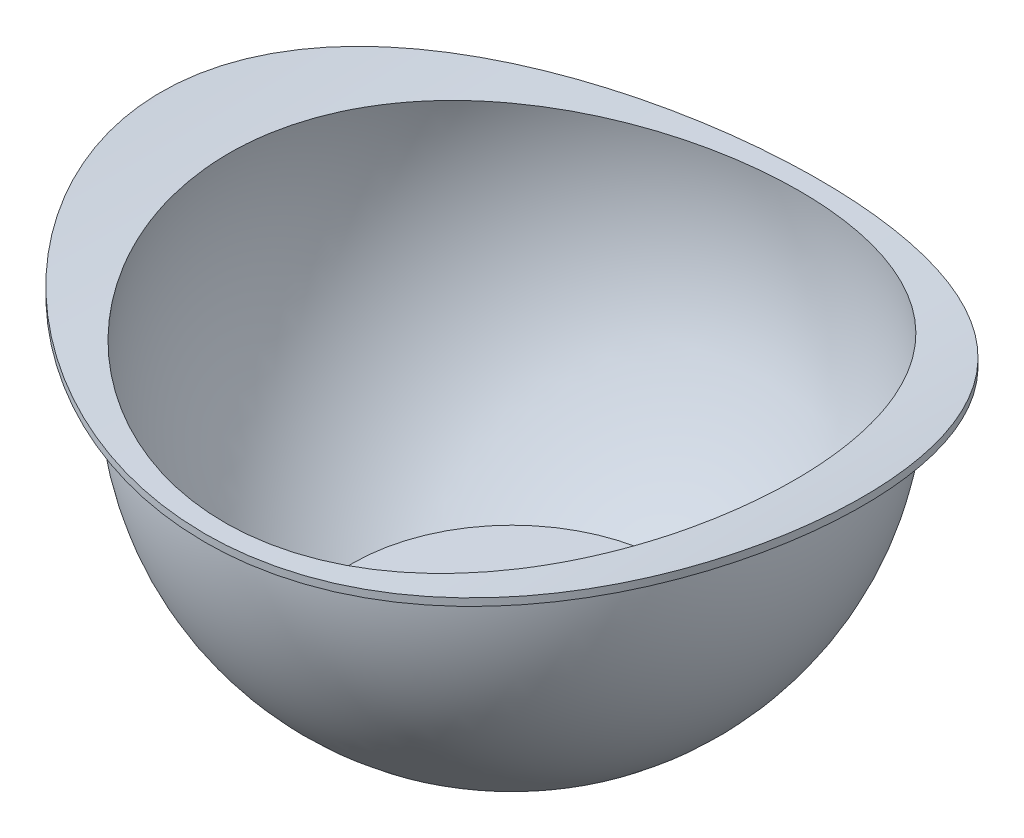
ISO-10303-21;
HEADER;
FILE_DESCRIPTION(('STEP AP214'),'2;1');
FILE_NAME('part.step','',(''),(''),'','','');
FILE_SCHEMA(('AUTOMOTIVE_DESIGN { 1 0 10303 214 1 1 1 1 }'));
ENDSEC;
DATA;
#1=APPLICATION_CONTEXT('core data for automotive mechanical design processes');
#2=APPLICATION_PROTOCOL_DEFINITION('international standard','automotive_design',2000,#1);
#3=PRODUCT_CONTEXT('',#1,'mechanical');
#4=PRODUCT('Part','Part','',(#3));
#5=PRODUCT_RELATED_PRODUCT_CATEGORY('part','',(#4));
#6=PRODUCT_DEFINITION_FORMATION('','',#4);
#7=PRODUCT_DEFINITION_CONTEXT('part definition',#1,'design');
#8=PRODUCT_DEFINITION('design','',#6,#7);
#9=PRODUCT_DEFINITION_SHAPE('','',#8);
#10=(LENGTH_UNIT() NAMED_UNIT(*) SI_UNIT(.MILLI.,.METRE.));
#11=(NAMED_UNIT(*) PLANE_ANGLE_UNIT() SI_UNIT($,.RADIAN.));
#12=(NAMED_UNIT(*) SI_UNIT($,.STERADIAN.) SOLID_ANGLE_UNIT());
#13=UNCERTAINTY_MEASURE_WITH_UNIT(LENGTH_MEASURE(1.E-05),#10,'distance_accuracy_value','');
#14=(GEOMETRIC_REPRESENTATION_CONTEXT(3) GLOBAL_UNCERTAINTY_ASSIGNED_CONTEXT((#13)) GLOBAL_UNIT_ASSIGNED_CONTEXT((#10,
#11,#12)) REPRESENTATION_CONTEXT('',''));
#15=CARTESIAN_POINT('',(0.,0.,0.));
#16=DIRECTION('',(0.,0.,1.));
#17=DIRECTION('',(1.,0.,0.));
#18=AXIS2_PLACEMENT_3D('',#15,#16,#17);
#19=CARTESIAN_POINT('',(0.,83.5164654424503,0.));
#20=DIRECTION('',(0.,-1.,0.));
#21=DIRECTION('',(0.,0.,-1.));
#22=AXIS2_PLACEMENT_3D('',#19,#20,#21);
#23=SPHERICAL_SURFACE('',#22,98.5);
#24=CARTESIAN_POINT('',(0.,1.5,0.));
#25=DIRECTION('',(0.,-1.,0.));
#26=DIRECTION('',(0.,0.,-1.));
#27=AXIS2_PLACEMENT_3D('',#24,#25,#26);
#28=CIRCLE('',#27,54.5485966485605);
#29=CARTESIAN_POINT('',(0.,1.50000000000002,-54.5485966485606));
#30=VERTEX_POINT('',#29);
#31=EDGE_CURVE('E48',#30,#30,#28,.T.);
#32=CARTESIAN_POINT('',(96.772582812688,101.88266308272,0.));
#33=CARTESIAN_POINT('',(96.772587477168,101.882666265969,-1.38358469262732));
#34=CARTESIAN_POINT('',(96.7442515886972,101.875596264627,-2.76705531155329));
#35=CARTESIAN_POINT('',(96.6309606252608,101.847373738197,-5.53163920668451));
#36=CARTESIAN_POINT('',(96.5460036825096,101.826220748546,-6.91275240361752));
#37=CARTESIAN_POINT('',(96.3195861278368,101.769976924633,-9.67012397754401));
#38=CARTESIAN_POINT('',(96.1781220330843,101.734885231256,-11.0463820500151));
#39=CARTESIAN_POINT('',(95.8388925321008,101.651011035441,-13.7916538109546));
#40=CARTESIAN_POINT('',(95.6411220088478,101.602227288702,-15.1606668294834));
#41=CARTESIAN_POINT('',(95.1894875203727,101.491292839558,-17.8894824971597));
#42=CARTESIAN_POINT('',(94.9355988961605,101.429136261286,-19.2492808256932));
#43=CARTESIAN_POINT('',(94.3721409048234,101.291905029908,-21.9567676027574));
#44=CARTESIAN_POINT('',(94.0625663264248,101.2168291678,-23.3044549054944));
#45=CARTESIAN_POINT('',(93.388268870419,101.054307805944,-25.9850289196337));
#46=CARTESIAN_POINT('',(93.0235528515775,100.966863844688,-27.317917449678));
#47=CARTESIAN_POINT('',(92.2394671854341,100.780212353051,-29.9668232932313));
#48=CARTESIAN_POINT('',(91.8200924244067,100.681003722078,-31.2828390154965));
#49=CARTESIAN_POINT('',(90.9275239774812,100.471573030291,-33.8950595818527));
#50=CARTESIAN_POINT('',(90.4543500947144,100.361355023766,-35.1912715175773));
#51=CARTESIAN_POINT('',(89.4547408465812,100.130646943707,-37.7622037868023));
#52=CARTESIAN_POINT('',(88.9283005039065,100.01015591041,-39.0369220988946));
#53=CARTESIAN_POINT('',(87.8230532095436,99.75977612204,-41.5623813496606));
#54=CARTESIAN_POINT('',(87.2442507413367,99.6298881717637,-42.8131243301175));
#55=CARTESIAN_POINT('',(86.0350854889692,99.3616153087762,-45.2886422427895));
#56=CARTESIAN_POINT('',(85.4047178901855,99.2232296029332,-46.5134147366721));
#57=CARTESIAN_POINT('',(84.0935486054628,98.9389754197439,-48.9345079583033));
#58=CARTESIAN_POINT('',(83.4127561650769,98.7931083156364,-50.1308338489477));
#59=CARTESIAN_POINT('',(82.001708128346,98.494904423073,-52.4931644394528));
#60=CARTESIAN_POINT('',(81.2714479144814,98.342567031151,-53.6591662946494));
#61=CARTESIAN_POINT('',(79.0082635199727,97.8774846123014,-57.1083187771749));
#62=CARTESIAN_POINT('',(77.4025789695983,97.5565911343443,-59.3432749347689));
#63=CARTESIAN_POINT('',(74.0078975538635,96.9022784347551,-63.6676411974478));
#64=CARTESIAN_POINT('',(72.2188638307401,96.568856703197,-65.757021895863));
#65=CARTESIAN_POINT('',(68.4690472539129,95.8989778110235,-69.7751785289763));
#66=CARTESIAN_POINT('',(66.5082640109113,95.5625206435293,-71.7039540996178));
#67=CARTESIAN_POINT('',(62.4279540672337,94.8961874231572,-75.3867819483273));
#68=CARTESIAN_POINT('',(60.3084289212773,94.5663113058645,-77.1408359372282));
#69=CARTESIAN_POINT('',(55.9249032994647,93.9225943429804,-80.4613646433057));
#70=CARTESIAN_POINT('',(53.660904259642,93.60875333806,-82.0278412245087));
#71=CARTESIAN_POINT('',(49.0271478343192,93.0091416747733,-84.9469888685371));
#72=CARTESIAN_POINT('',(46.6586588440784,92.723123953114,-86.3016224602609));
#73=CARTESIAN_POINT('',(41.8118680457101,92.1838211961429,-88.8054461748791));
#74=CARTESIAN_POINT('',(39.3335667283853,91.9305360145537,-89.954637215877));
#75=CARTESIAN_POINT('',(34.2850784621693,91.4639812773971,-92.0387515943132));
#76=CARTESIAN_POINT('',(31.7149007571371,91.2507077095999,-92.9736964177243));
#77=CARTESIAN_POINT('',(26.501187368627,90.870299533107,-94.6222444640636));
#78=CARTESIAN_POINT('',(23.8576528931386,90.7031641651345,-95.3358513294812));
#79=CARTESIAN_POINT('',(18.5723052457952,90.4228146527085,-96.5237011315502));
#80=CARTESIAN_POINT('',(15.9315935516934,90.3085540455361,-97.0026016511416));
#81=CARTESIAN_POINT('',(10.617782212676,90.1321106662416,-97.7391846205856));
#82=CARTESIAN_POINT('',(7.94468302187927,90.0699271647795,-97.9968701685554));
#83=CARTESIAN_POINT('',(2.58583295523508,89.9993831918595,-98.2890464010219));
#84=CARTESIAN_POINT('',(-0.0999168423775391,89.991018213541,-98.3235557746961));
#85=CARTESIAN_POINT('',(-5.46460294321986,90.0283344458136,-98.1691641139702));
#86=CARTESIAN_POINT('',(-8.14353928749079,90.0740153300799,-97.9802644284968));
#87=CARTESIAN_POINT('',(-13.4376256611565,90.2171284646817,-97.3847132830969));
#88=CARTESIAN_POINT('',(-16.0531435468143,90.3138268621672,-96.9811489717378));
#89=CARTESIAN_POINT('',(-21.2400255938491,90.5558836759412,-95.9612337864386));
#90=CARTESIAN_POINT('',(-23.8113902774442,90.7012415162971,-95.3448854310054));
#91=CARTESIAN_POINT('',(-28.8920791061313,91.0366810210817,-93.9039125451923));
#92=CARTESIAN_POINT('',(-31.4014029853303,91.2267628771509,-93.0792871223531));
#93=CARTESIAN_POINT('',(-36.3408347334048,91.6465287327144,-91.2277181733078));
#94=CARTESIAN_POINT('',(-38.7709418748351,91.8762130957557,-90.2007727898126));
#95=CARTESIAN_POINT('',(-43.5507366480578,92.3705955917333,-87.9447405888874));
#96=CARTESIAN_POINT('',(-45.8998167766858,92.6355064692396,-86.7144135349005));
#97=CARTESIAN_POINT('',(-50.4856338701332,93.1920658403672,-84.0649949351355));
#98=CARTESIAN_POINT('',(-52.7223706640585,93.4837143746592,-82.6459031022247));
#99=CARTESIAN_POINT('',(-57.0691890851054,94.0859647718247,-79.6287263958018));
#100=CARTESIAN_POINT('',(-59.1792611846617,94.3965680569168,-78.0306280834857));
#101=CARTESIAN_POINT('',(-63.259255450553,95.0284452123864,-74.6664717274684));
#102=CARTESIAN_POINT('',(-65.2291756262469,95.3497192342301,-72.9004112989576));
#103=CARTESIAN_POINT('',(-69.0550210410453,96.0009568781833,-69.1749373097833));
#104=CARTESIAN_POINT('',(-70.9078351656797,96.3309648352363,-67.212335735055));
#105=CARTESIAN_POINT('',(-74.4432700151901,96.9841832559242,-63.138350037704));
#106=CARTESIAN_POINT('',(-76.1258886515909,97.3073936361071,-61.0269640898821));
#107=CARTESIAN_POINT('',(-79.3106592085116,97.9381991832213,-56.6697873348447));
#108=CARTESIAN_POINT('',(-80.812798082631,98.2457932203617,-54.4239868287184));
#109=CARTESIAN_POINT('',(-83.6273426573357,98.8369441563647,-49.8134788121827));
#110=CARTESIAN_POINT('',(-84.9397469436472,99.1205008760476,-47.448770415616));
#111=CARTESIAN_POINT('',(-87.3862718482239,99.6601037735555,-42.5780607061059));
#112=CARTESIAN_POINT('',(-88.5172209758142,99.9156400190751,-40.0704091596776));
#113=CARTESIAN_POINT('',(-90.5681983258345,100.386718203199,-34.9666336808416));
#114=CARTESIAN_POINT('',(-91.4882241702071,100.602259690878,-32.3705087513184));
#115=CARTESIAN_POINT('',(-93.1117323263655,100.987272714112,-27.1080365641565));
#116=CARTESIAN_POINT('',(-93.8152116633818,101.156743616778,-24.4416883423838));
#117=CARTESIAN_POINT('',(-95.0013182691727,101.444826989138,-19.0576207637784));
#118=CARTESIAN_POINT('',(-95.4839458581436,101.563439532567,-16.3399014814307));
#119=CARTESIAN_POINT('',(-96.2265256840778,101.746728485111,-10.8640915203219));
#120=CARTESIAN_POINT('',(-96.4858058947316,101.811242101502,-8.10590422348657));
#121=CARTESIAN_POINT('',(-96.7776465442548,101.883896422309,-2.57681464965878));
#122=CARTESIAN_POINT('',(-96.8102063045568,101.892036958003,0.194087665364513));
#123=CARTESIAN_POINT('',(-96.648405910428,101.851713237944,5.72884280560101));
#124=CARTESIAN_POINT('',(-96.4540460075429,101.803249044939,8.49269563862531));
#125=CARTESIAN_POINT('',(-95.8395958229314,101.65109530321,13.9936547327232));
#126=CARTESIAN_POINT('',(-95.4195058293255,101.547405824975,16.7307610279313));
#127=CARTESIAN_POINT('',(-94.3568313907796,101.287912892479,22.1553659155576));
#128=CARTESIAN_POINT('',(-93.7145249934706,101.132174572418,24.8429221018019));
#129=CARTESIAN_POINT('',(-92.2112377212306,100.772965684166,30.1528938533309));
#130=CARTESIAN_POINT('',(-91.3502569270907,100.56949513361,32.7753094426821));
#131=CARTESIAN_POINT('',(-89.4148747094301,100.120574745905,37.9365295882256));
#132=CARTESIAN_POINT('',(-88.3404681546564,99.8751238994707,40.4753321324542));
#133=CARTESIAN_POINT('',(-85.9848630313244,99.3491855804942,45.4513462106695));
#134=CARTESIAN_POINT('',(-84.7036641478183,99.0686980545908,47.8885575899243));
#135=CARTESIAN_POINT('',(-81.9404120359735,98.4801840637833,52.6476478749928));
#136=CARTESIAN_POINT('',(-80.4580691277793,98.1721181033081,54.9693537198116));
#137=CARTESIAN_POINT('',(-77.3032829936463,97.5375301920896,59.4771475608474));
#138=CARTESIAN_POINT('',(-75.6308393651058,97.2110082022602,61.6632352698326));
#139=CARTESIAN_POINT('',(-72.1065191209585,96.5487785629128,65.8841993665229));
#140=CARTESIAN_POINT('',(-70.2546413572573,96.2130708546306,67.9190747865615));
#141=CARTESIAN_POINT('',(-66.3835079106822,95.5420330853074,71.8229386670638));
#142=CARTESIAN_POINT('',(-64.3642530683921,95.2067030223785,73.6919279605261));
#143=CARTESIAN_POINT('',(-60.1808780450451,94.547442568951,77.2426832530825));
#144=CARTESIAN_POINT('',(-58.017424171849,94.223469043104,78.9252261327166));
#145=CARTESIAN_POINT('',(-53.5524774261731,93.5946345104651,82.1000316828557));
#146=CARTESIAN_POINT('',(-51.2509846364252,93.2897734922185,83.5922944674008));
#147=CARTESIAN_POINT('',(-46.5260753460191,92.7079302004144,86.3753022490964));
#148=CARTESIAN_POINT('',(-44.1026681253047,92.430945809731,87.6660625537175));
#149=CARTESIAN_POINT('',(-39.1509948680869,91.9128296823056,90.0363917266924));
#150=CARTESIAN_POINT('',(-36.6227304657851,91.6716973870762,91.1159638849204));
#151=CARTESIAN_POINT('',(-31.5252154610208,91.2361752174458,93.0384443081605));
#152=CARTESIAN_POINT('',(-28.9574789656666,91.0410345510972,93.8851980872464));
#153=CARTESIAN_POINT('',(-23.7569902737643,90.6976143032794,95.3604797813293));
#154=CARTESIAN_POINT('',(-21.1242387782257,90.5493342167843,95.9890100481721));
#155=CARTESIAN_POINT('',(-15.8132101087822,90.3038551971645,97.0229722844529));
#156=CARTESIAN_POINT('',(-13.1349376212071,90.2066510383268,97.4284270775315));
#157=CARTESIAN_POINT('',(-7.75242208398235,90.0660715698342,98.0131911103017));
#158=CARTESIAN_POINT('',(-5.04817934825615,90.0226956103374,98.1925030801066));
#159=CARTESIAN_POINT('',(0.313925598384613,89.9913110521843,98.3223340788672));
#160=CARTESIAN_POINT('',(2.97167756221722,90.0022517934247,98.2771946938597));
#161=CARTESIAN_POINT('',(8.27368570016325,90.0767884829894,97.9684188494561));
#162=CARTESIAN_POINT('',(10.9179420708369,90.1403836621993,97.7047855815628));
#163=CARTESIAN_POINT('',(16.1739822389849,90.3184806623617,96.9610099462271));
#164=CARTESIAN_POINT('',(18.7857671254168,90.4329807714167,96.480874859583));
#165=CARTESIAN_POINT('',(23.9584729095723,90.7097541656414,95.3076633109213));
#166=CARTESIAN_POINT('',(26.5193936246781,90.8720276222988,94.6145860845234));
#167=CARTESIAN_POINT('',(31.5662683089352,91.239473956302,93.0225441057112));
#168=CARTESIAN_POINT('',(34.0523910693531,91.4445404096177,92.1240895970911));
#169=CARTESIAN_POINT('',(38.9392601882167,91.8922818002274,90.1268417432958));
#170=CARTESIAN_POINT('',(41.3400069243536,92.1349565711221,89.0280492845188));
#171=CARTESIAN_POINT('',(46.040230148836,92.6514279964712,86.637852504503));
#172=CARTESIAN_POINT('',(48.3397030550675,92.9252257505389,85.3464413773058));
#173=CARTESIAN_POINT('',(52.8222487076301,93.4966372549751,82.5801164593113));
#174=CARTESIAN_POINT('',(55.0053199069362,93.7942513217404,81.105200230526));
#175=CARTESIAN_POINT('',(59.2763119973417,94.4105037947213,77.9559963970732));
#176=CARTESIAN_POINT('',(61.3620804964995,94.7294072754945,76.2788314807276));
#177=CARTESIAN_POINT('',(64.3793513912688,95.2135530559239,73.6379133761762));
#178=CARTESIAN_POINT('',(65.3666705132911,95.3759223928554,72.7366153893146));
#179=CARTESIAN_POINT('',(67.3027808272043,95.7015106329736,70.8937386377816));
#180=CARTESIAN_POINT('',(68.251575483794,95.8647294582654,69.9521635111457));
#181=CARTESIAN_POINT('',(70.1094267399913,96.1909621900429,68.030061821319));
#182=CARTESIAN_POINT('',(71.0184718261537,96.3539760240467,67.0495241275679));
#183=CARTESIAN_POINT('',(72.7950780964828,96.6786403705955,65.0514948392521));
#184=CARTESIAN_POINT('',(73.6626429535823,96.8402910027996,64.034006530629));
#185=CARTESIAN_POINT('',(75.3551204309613,97.1611681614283,61.963631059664));
#186=CARTESIAN_POINT('',(76.1800291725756,97.3203944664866,60.9107406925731));
#187=CARTESIAN_POINT('',(77.7857915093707,97.6353226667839,58.7715222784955));
#188=CARTESIAN_POINT('',(78.5666489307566,97.7910248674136,57.6851971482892));
#189=CARTESIAN_POINT('',(80.0984395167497,98.1009532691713,55.458719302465));
#190=CARTESIAN_POINT('',(80.8484572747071,98.2550870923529,54.317923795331));
#191=CARTESIAN_POINT('',(82.3002817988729,98.5575222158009,52.0054494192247));
#192=CARTESIAN_POINT('',(83.0020928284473,98.7058240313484,50.8337732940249));
#193=CARTESIAN_POINT('',(84.356586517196,98.9955932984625,48.4613242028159));
#194=CARTESIAN_POINT('',(85.0092625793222,99.1370598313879,47.2605473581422));
#195=CARTESIAN_POINT('',(86.2643220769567,99.4121360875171,44.8322549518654));
#196=CARTESIAN_POINT('',(86.8667101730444,99.5457465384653,43.6047418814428));
#197=CARTESIAN_POINT('',(88.0201133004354,99.8041404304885,41.1254966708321));
#198=CARTESIAN_POINT('',(88.5711485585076,99.9289273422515,39.8737743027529));
#199=CARTESIAN_POINT('',(89.6212288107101,100.168850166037,37.3479361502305));
#200=CARTESIAN_POINT('',(90.1202784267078,100.283986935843,36.0738223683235));
#201=CARTESIAN_POINT('',(91.065662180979,100.503811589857,33.5053687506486));
#202=CARTESIAN_POINT('',(91.5119995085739,100.60850010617,32.2110301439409));
#203=CARTESIAN_POINT('',(92.3512901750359,100.806699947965,29.6044232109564));
#204=CARTESIAN_POINT('',(92.7442451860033,100.900211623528,28.292155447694));
#205=CARTESIAN_POINT('',(93.7172439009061,101.133094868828,24.78234469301));
#206=CARTESIAN_POINT('',(94.2501098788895,101.262120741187,22.5708295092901));
#207=CARTESIAN_POINT('',(95.1650670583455,101.485094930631,18.1155393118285));
#208=CARTESIAN_POINT('',(95.5471777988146,101.579047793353,15.8717685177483));
#209=CARTESIAN_POINT('',(96.1592095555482,101.730112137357,11.3623324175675));
#210=CARTESIAN_POINT('',(96.3891303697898,101.787223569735,9.09666708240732));
#211=CARTESIAN_POINT('',(96.6958234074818,101.863498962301,4.55389919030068));
#212=CARTESIAN_POINT('',(96.7725751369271,101.882657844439,2.27679514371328));
#213=CARTESIAN_POINT('',(96.772582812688,101.88266308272,0.));
#214=B_SPLINE_CURVE_WITH_KNOTS('',3,(#32,#33,#34,#35,#36,#37,#38,#39,#40,#41,#42,#43,#44,#45,
#46,#47,#48,#49,#50,#51,#52,#53,#54,#55,#56,#57,#58,#59,#60,#61,#62,#63,#64,#65,#66,#67,#68,#69,
#70,#71,#72,#73,#74,#75,#76,#77,#78,#79,#80,#81,#82,#83,#84,#85,#86,#87,#88,#89,#90,#91,#92,#93,
#94,#95,#96,#97,#98,#99,#100,#101,#102,#103,#104,#105,#106,#107,#108,#109,#110,#111,#112,#113,
#114,#115,#116,#117,#118,#119,#120,#121,#122,#123,#124,#125,#126,#127,#128,#129,#130,#131,#132,
#133,#134,#135,#136,#137,#138,#139,#140,#141,#142,#143,#144,#145,#146,#147,#148,#149,#150,#151,
#152,#153,#154,#155,#156,#157,#158,#159,#160,#161,#162,#163,#164,#165,#166,#167,#168,#169,#170,
#171,#172,#173,#174,#175,#176,#177,#178,#179,#180,#181,#182,#183,#184,#185,#186,#187,#188,#189,
#190,#191,#192,#193,#194,#195,#196,#197,#198,#199,#200,#201,#202,#203,#204,#205,#206,#207,#208,
#209,#210,#211,#212,#213),.UNSPECIFIED.,.T.,.F.,(4,2,2,2,2,2,2,2,2,2,2,2,2,2,2,2,2,2,2,2,2,2,2,
2,2,2,2,2,2,2,2,2,2,2,2,2,2,2,2,2,2,2,2,2,2,2,2,2,2,2,2,2,2,2,2,2,2,2,2,2,2,2,2,2,2,2,2,2,2,2,2,
2,2,2,2,2,2,2,2,2,2,2,2,2,2,2,2,2,2,2,4),(0.,4.15024852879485,8.30063397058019,12.4512752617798,
16.6022938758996,20.7551401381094,24.9083752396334,29.0610941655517,33.2142018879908,
37.3657857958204,41.5177579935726,45.6693750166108,49.8213801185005,53.9726258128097,
58.1242595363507,66.4252750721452,74.727962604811,83.0306689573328,91.3332940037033,
99.6358365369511,107.856211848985,116.076550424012,124.296064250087,132.515442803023,
140.564346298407,148.613137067,156.661253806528,164.709321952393,172.644659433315,
180.57990299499,188.515180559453,196.450530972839,204.436188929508,212.421859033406,
220.40812905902,228.394512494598,236.54241104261,244.690409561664,252.83899672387,
260.987644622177,269.266040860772,277.544530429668,285.823133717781,294.101725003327,
302.405139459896,310.708578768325,319.012008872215,327.315428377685,335.608495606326,
343.901559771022,352.194823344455,360.488099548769,368.793448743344,377.098815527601,
385.404235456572,393.709613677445,401.978969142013,410.248319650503,418.51704165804,
426.785634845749,434.908091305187,443.030460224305,451.151997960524,459.273437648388,
467.238401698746,475.203249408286,483.167829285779,491.132437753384,499.077469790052,
507.022466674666,514.967744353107,522.913127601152,530.989042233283,535.028090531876,
539.066774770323,543.106621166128,547.146109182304,551.185963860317,555.22546710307,
559.346062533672,563.466293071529,567.587075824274,571.707476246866,575.826246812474,
579.944650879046,584.062805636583,588.180831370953,595.010347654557,601.83897849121,
608.667618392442,615.497171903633),.UNSPECIFIED.);
#215=CARTESIAN_POINT('',(0.,90.,-98.2863865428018));
#216=VERTEX_POINT('',#215);
#217=EDGE_CURVE('E54',#216,#216,#214,.T.);
#218=CARTESIAN_POINT('',(0.,1.50000000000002,-54.5485966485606));
#219=CARTESIAN_POINT('',(0.,2.09648000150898,-55.4454456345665));
#220=CARTESIAN_POINT('',(0.,2.70768136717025,-56.3325030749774));
#221=CARTESIAN_POINT('',(0.,3.95884472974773,-58.086097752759));
#222=CARTESIAN_POINT('',(0.,4.59880672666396,-58.9526349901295));
#223=CARTESIAN_POINT('',(0.,5.9068092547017,-60.6642521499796));
#224=CARTESIAN_POINT('',(0.,6.57484978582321,-61.5093320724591));
#225=CARTESIAN_POINT('',(0.,7.93828877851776,-63.1771264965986));
#226=CARTESIAN_POINT('',(0.,8.63368724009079,-63.9998409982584));
#227=CARTESIAN_POINT('',(0.,10.0510942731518,-65.6220189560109));
#228=CARTESIAN_POINT('',(0.,10.7731028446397,-66.4214824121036));
#229=CARTESIAN_POINT('',(0.,12.2429530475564,-67.9962980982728));
#230=CARTESIAN_POINT('',(0.,12.9907946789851,-68.7716503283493));
#231=CARTESIAN_POINT('',(0.,14.5115063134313,-70.2974092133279));
#232=CARTESIAN_POINT('',(0.,15.2843763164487,-71.04781586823));
#233=CARTESIAN_POINT('',(0.,16.8543130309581,-72.5228761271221));
#234=CARTESIAN_POINT('',(0.,17.65137974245,-73.2475297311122));
#235=CARTESIAN_POINT('',(0.,19.2688521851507,-74.6703041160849));
#236=CARTESIAN_POINT('',(0.,20.0892579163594,-75.3684248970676));
#237=CARTESIAN_POINT('',(0.,21.7525255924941,-76.7373824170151));
#238=CARTESIAN_POINT('',(0.,22.59538753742,-77.4082191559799));
#239=CARTESIAN_POINT('',(0.,24.3026606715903,-78.7218867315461));
#240=CARTESIAN_POINT('',(0.,25.1670718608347,-79.3647175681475));
#241=CARTESIAN_POINT('',(0.,26.9165133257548,-80.6216816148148));
#242=CARTESIAN_POINT('',(0.,27.8015436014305,-81.2358148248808));
#243=CARTESIAN_POINT('',(0.,29.5912708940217,-82.4347227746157));
#244=CARTESIAN_POINT('',(0.,30.4959679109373,-83.0194975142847));
#245=CARTESIAN_POINT('',(0.,32.3240551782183,-84.1590592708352));
#246=CARTESIAN_POINT('',(0.,33.2474454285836,-84.7138462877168));
#247=CARTESIAN_POINT('',(0.,35.1119255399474,-85.7928356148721));
#248=CARTESIAN_POINT('',(0.,36.0530154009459,-86.3170379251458));
#249=CARTESIAN_POINT('',(0.,37.9518820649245,-87.3342937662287));
#250=CARTESIAN_POINT('',(0.,38.9096588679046,-87.8273472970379));
#251=CARTESIAN_POINT('',(0.,40.8408687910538,-88.7817750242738));
#252=CARTESIAN_POINT('',(0.,41.8143019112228,-89.2431492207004));
#253=CARTESIAN_POINT('',(0.,43.7757769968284,-90.1337218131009));
#254=CARTESIAN_POINT('',(0.,44.763818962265,-90.5629202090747));
#255=CARTESIAN_POINT('',(0.,46.7534485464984,-91.3886793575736));
#256=CARTESIAN_POINT('',(0.,47.7550361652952,-91.7852401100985));
#257=CARTESIAN_POINT('',(0.,49.7706792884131,-92.5452972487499));
#258=CARTESIAN_POINT('',(0.,50.7847347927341,-92.9087936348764));
#259=CARTESIAN_POINT('',(0.,52.8242225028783,-93.6023308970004));
#260=CARTESIAN_POINT('',(0.,53.8496547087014,-93.932371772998));
#261=CARTESIAN_POINT('',(0.,55.9107923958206,-94.5586428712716));
#262=CARTESIAN_POINT('',(0.,56.9464978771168,-94.8548730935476));
#263=CARTESIAN_POINT('',(0.,59.0270676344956,-95.4132041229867));
#264=CARTESIAN_POINT('',(0.,60.0719319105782,-95.6753049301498));
#265=CARTESIAN_POINT('',(0.,62.1696949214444,-96.1650950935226));
#266=CARTESIAN_POINT('',(0.,63.222593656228,-96.3927844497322));
#267=CARTESIAN_POINT('',(0.,65.3352926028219,-96.8135067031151));
#268=CARTESIAN_POINT('',(0.,66.3950928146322,-97.0065396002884));
#269=CARTESIAN_POINT('',(0.,68.5204543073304,-97.3577412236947));
#270=CARTESIAN_POINT('',(0.,69.5860155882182,-97.5159099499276));
#271=CARTESIAN_POINT('',(0.,71.7217526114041,-97.7972130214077));
#272=CARTESIAN_POINT('',(0.,72.7919283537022,-97.9203473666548));
#273=CARTESIAN_POINT('',(0.,74.9357427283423,-98.1314492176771));
#274=CARTESIAN_POINT('',(0.,76.0093813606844,-98.2194167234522));
#275=CARTESIAN_POINT('',(0.,78.1589662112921,-98.3600900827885));
#276=CARTESIAN_POINT('',(0.,79.2349124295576,-98.4127959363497));
#277=CARTESIAN_POINT('',(0.,81.3879546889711,-98.4828898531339));
#278=CARTESIAN_POINT('',(0.,82.465050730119,-98.5002779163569));
#279=CARTESIAN_POINT('',(0.,84.6192335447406,-98.4997153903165));
#280=CARTESIAN_POINT('',(0.,85.6963203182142,-98.481764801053));
#281=CARTESIAN_POINT('',(0.,87.849325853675,-98.410552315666));
#282=CARTESIAN_POINT('',(0.,88.9252446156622,-98.3572904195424));
#283=CARTESIAN_POINT('',(0.,90.,-98.2863865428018));
#284=B_SPLINE_CURVE_WITH_KNOTS('',3,(#218,#219,#220,#221,#222,#223,#224,#225,#226,#227,#228,
#229,#230,#231,#232,#233,#234,#235,#236,#237,#238,#239,#240,#241,#242,#243,#244,#245,#246,#247,
#248,#249,#250,#251,#252,#253,#254,#255,#256,#257,#258,#259,#260,#261,#262,#263,#264,#265,#266,
#267,#268,#269,#270,#271,#272,#273,#274,#275,#276,#277,#278,#279,#280,#281,#282,#283),
.UNSPECIFIED.,.F.,.F.,(4,2,2,2,2,2,2,2,2,2,2,2,2,2,2,2,2,2,2,2,2,2,2,2,2,2,2,2,2,2,2,2,4),(0.,
3.23112951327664,6.46225902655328,9.69338853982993,12.9245180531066,16.1556475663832,
19.3867770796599,22.6179065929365,25.8490361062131,29.0801656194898,32.3112951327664,
35.5424246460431,38.7735541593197,42.0046836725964,45.235813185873,48.4669426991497,
51.6980722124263,54.9292017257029,58.1603312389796,61.3914607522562,64.6225902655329,
67.8537197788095,71.0848492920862,74.3159788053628,77.5471083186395,80.7782378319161,
84.0093673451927,87.2404968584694,90.471626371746,93.7027558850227,96.9338853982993,
100.165014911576,103.396144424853),.UNSPECIFIED.);
#285=EDGE_CURVE('BSEAM35',#30,#216,#284,.T.);
#286=ORIENTED_EDGE('',*,*,#31,.T.);
#287=ORIENTED_EDGE('',*,*,#217,.T.);
#288=ORIENTED_EDGE('',*,*,#285,.T.);
#289=ORIENTED_EDGE('',*,*,#285,.F.);
#290=EDGE_LOOP('',(#286,#288,#287,#289));
#291=FACE_BOUND('',#290,.T.);
#292=ADVANCED_FACE('F35',(#291),#23,.F.);
#293=CARTESIAN_POINT('',(0.,1.5,0.));
#294=DIRECTION('',(0.,-1.,0.));
#295=DIRECTION('',(0.,0.,-1.));
#296=AXIS2_PLACEMENT_3D('',#293,#294,#295);
#297=PLANE('',#296);
#298=ORIENTED_EDGE('',*,*,#31,.F.);
#299=EDGE_LOOP('',(#298));
#300=FACE_BOUND('',#299,.T.);
#301=ADVANCED_FACE('F70',(#300),#297,.F.);
#302=CARTESIAN_POINT('',(0.,490.,105.));
#303=DIRECTION('',(0.,0.,-1.));
#304=DIRECTION('',(-1.,0.,0.));
#305=AXIS2_PLACEMENT_3D('',#302,#303,#304);
#306=CYLINDRICAL_SURFACE('',#305,400.);
#307=ORIENTED_EDGE('',*,*,#217,.F.);
#308=EDGE_LOOP('',(#307));
#309=FACE_BOUND('',#308,.T.);
#310=CARTESIAN_POINT('',(-2.85386398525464E-13,90.,105.));
#311=CARTESIAN_POINT('',(-1.92421500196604,90.0000002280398,104.999999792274));
#312=CARTESIAN_POINT('',(-3.84844061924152,90.0138933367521,104.959499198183));
#313=CARTESIAN_POINT('',(-7.69310145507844,90.0693654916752,104.797534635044));
#314=CARTESIAN_POINT('',(-9.61353662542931,90.1109448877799,104.676069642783));
#315=CARTESIAN_POINT('',(-13.4467615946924,90.2214850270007,104.352296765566));
#316=CARTESIAN_POINT('',(-15.3595514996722,90.2904453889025,104.149990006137));
#317=CARTESIAN_POINT('',(-19.1736870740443,90.4552424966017,103.664730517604));
#318=CARTESIAN_POINT('',(-21.0750329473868,90.5510787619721,103.38177923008));
#319=CARTESIAN_POINT('',(-24.7237184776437,90.7609385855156,102.759185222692));
#320=CARTESIAN_POINT('',(-26.4721350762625,90.8731151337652,102.42521509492));
#321=CARTESIAN_POINT('',(-29.9528805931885,91.1192297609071,101.688519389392));
#322=CARTESIAN_POINT('',(-31.6852095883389,91.2531677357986,101.285794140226));
#323=CARTESIAN_POINT('',(-35.1306516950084,91.5419397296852,100.411937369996));
#324=CARTESIAN_POINT('',(-36.8437659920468,91.6967724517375,99.9408100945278));
#325=CARTESIAN_POINT('',(-40.2478755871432,92.0263417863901,98.9304996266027));
#326=CARTESIAN_POINT('',(-41.9388708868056,92.2010783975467,98.3913164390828));
#327=CARTESIAN_POINT('',(-45.2671784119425,92.5661847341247,97.2550557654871));
#328=CARTESIAN_POINT('',(-46.9049145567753,92.7562382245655,96.6591182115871));
#329=CARTESIAN_POINT('',(-50.1533449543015,93.1532793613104,95.4022741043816));
#330=CARTESIAN_POINT('',(-51.7640369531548,93.3602684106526,94.741362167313));
#331=CARTESIAN_POINT('',(-54.955165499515,93.7898013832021,93.3551713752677));
#332=CARTESIAN_POINT('',(-56.5356052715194,94.0123436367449,92.6298994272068));
#333=CARTESIAN_POINT('',(-59.6636202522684,94.4715541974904,91.1153921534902));
#334=CARTESIAN_POINT('',(-61.2111926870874,94.7082236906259,90.3261514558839));
#335=CARTESIAN_POINT('',(-64.2169084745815,95.1855844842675,88.7130365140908));
#336=CARTESIAN_POINT('',(-65.6762871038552,95.425846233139,87.8913363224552));
#337=CARTESIAN_POINT('',(-68.5589698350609,95.9164993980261,86.189459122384));
#338=CARTESIAN_POINT('',(-69.9822710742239,96.1668916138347,85.3092774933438));
#339=CARTESIAN_POINT('',(-72.7899257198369,96.6761355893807,83.4911266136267));
#340=CARTESIAN_POINT('',(-74.1742791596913,96.9349873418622,82.5531574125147));
#341=CARTESIAN_POINT('',(-76.9012236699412,97.4593912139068,80.6201318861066));
#342=CARTESIAN_POINT('',(-78.2438153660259,97.7249432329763,79.6250764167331));
#343=CARTESIAN_POINT('',(-80.8121212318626,98.2462215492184,77.6346459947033));
#344=CARTESIAN_POINT('',(-82.0402108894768,98.5016904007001,76.6422678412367));
#345=CARTESIAN_POINT('',(-84.4539263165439,99.0152731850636,74.6080116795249));
#346=CARTESIAN_POINT('',(-85.6395562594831,99.2733868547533,73.5661385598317));
#347=CARTESIAN_POINT('',(-87.9655883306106,99.790473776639,71.4339387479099));
#348=CARTESIAN_POINT('',(-89.1060034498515,100.049446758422,70.343626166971));
#349=CARTESIAN_POINT('',(-91.3392462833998,100.566493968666,68.1153073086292));
#350=CARTESIAN_POINT('',(-92.4320790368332,100.824568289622,66.9773061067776));
#351=CARTESIAN_POINT('',(-94.49279253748,101.319983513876,64.7359373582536));
#352=CARTESIAN_POINT('',(-95.4640638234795,101.557510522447,63.635727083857));
#353=CARTESIAN_POINT('',(-97.3609820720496,102.028616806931,61.3959302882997));
#354=CARTESIAN_POINT('',(-98.2866318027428,102.262196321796,60.2563461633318));
#355=CARTESIAN_POINT('',(-100.091180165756,102.724098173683,57.9374791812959));
#356=CARTESIAN_POINT('',(-100.970022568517,102.952414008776,56.7581512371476));
#357=CARTESIAN_POINT('',(-102.677632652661,103.401909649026,54.3621378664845));
#358=CARTESIAN_POINT('',(-103.506390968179,103.623088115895,53.1454455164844));
#359=CARTESIAN_POINT('',(-105.315564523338,104.111778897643,50.3621401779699));
#360=CARTESIAN_POINT('',(-106.280922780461,104.376763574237,48.7852527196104));
#361=CARTESIAN_POINT('',(-108.124622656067,104.889649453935,45.5779785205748));
#362=CARTESIAN_POINT('',(-109.002934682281,105.137544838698,43.9475738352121));
#363=CARTESIAN_POINT('',(-110.667818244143,105.612976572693,40.637189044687));
#364=CARTESIAN_POINT('',(-111.454370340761,105.840508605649,38.9571985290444));
#365=CARTESIAN_POINT('',(-112.930483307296,106.271845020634,35.5537523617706));
#366=CARTESIAN_POINT('',(-113.620122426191,106.475668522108,33.8303331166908));
#367=CARTESIAN_POINT('',(-114.89885659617,106.856817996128,30.3440795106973));
#368=CARTESIAN_POINT('',(-115.487971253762,107.03414913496,28.5812529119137));
#369=CARTESIAN_POINT('',(-116.56172887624,107.359596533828,25.0223117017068));
#370=CARTESIAN_POINT('',(-117.046426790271,107.507728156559,23.2262151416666));
#371=CARTESIAN_POINT('',(-117.786494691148,107.735110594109,20.1181369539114));
#372=CARTESIAN_POINT('',(-118.067957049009,107.82199480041,18.8128616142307));
#373=CARTESIAN_POINT('',(-118.574562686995,107.978870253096,16.1906147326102));
#374=CARTESIAN_POINT('',(-118.799716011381,108.048864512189,14.8736453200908));
#375=CARTESIAN_POINT('',(-119.192720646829,108.171324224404,12.2315907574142));
#376=CARTESIAN_POINT('',(-119.360623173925,108.223805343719,10.9065139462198));
#377=CARTESIAN_POINT('',(-119.638762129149,108.310875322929,8.24966872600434));
#378=CARTESIAN_POINT('',(-119.748996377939,108.345463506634,6.91790006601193));
#379=CARTESIAN_POINT('',(-119.904063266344,108.394154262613,4.37027006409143));
#380=CARTESIAN_POINT('',(-119.953879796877,108.409817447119,3.15473903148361));
#381=CARTESIAN_POINT('',(-120.005207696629,108.425956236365,0.722639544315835));
#382=CARTESIAN_POINT('',(-120.006722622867,108.426432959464,-0.493928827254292));
#383=CARTESIAN_POINT('',(-119.961434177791,108.412192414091,-2.92683131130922));
#384=CARTESIAN_POINT('',(-119.914601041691,108.397465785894,-4.14316481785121));
#385=CARTESIAN_POINT('',(-119.772719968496,108.35291046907,-6.57292939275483));
#386=CARTESIAN_POINT('',(-119.677663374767,108.323079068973,-7.78635990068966));
#387=CARTESIAN_POINT('',(-119.398055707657,108.235500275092,-10.6309947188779));
#388=CARTESIAN_POINT('',(-119.193844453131,108.171642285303,-12.260119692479));
#389=CARTESIAN_POINT('',(-118.699279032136,108.017607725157,-15.5045802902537));
#390=CARTESIAN_POINT('',(-118.408890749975,107.927420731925,-17.1199101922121));
#391=CARTESIAN_POINT('',(-117.743629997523,107.721882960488,-20.3315918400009));
#392=CARTESIAN_POINT('',(-117.368750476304,107.606530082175,-21.9279419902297));
#393=CARTESIAN_POINT('',(-116.536037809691,107.351935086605,-25.0991365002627));
#394=CARTESIAN_POINT('',(-116.078097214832,107.212662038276,-26.6739501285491));
#395=CARTESIAN_POINT('',(-115.08204604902,106.912029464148,-29.7956794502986));
#396=CARTESIAN_POINT('',(-114.543942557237,106.750671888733,-31.3425975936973));
#397=CARTESIAN_POINT('',(-113.39020129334,106.407736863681,-34.4049400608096));
#398=CARTESIAN_POINT('',(-112.774564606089,106.226159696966,-35.9203648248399));
#399=CARTESIAN_POINT('',(-111.613645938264,105.88715993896,-38.583694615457));
#400=CARTESIAN_POINT('',(-111.083083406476,105.733323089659,-39.7385071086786));
#401=CARTESIAN_POINT('',(-109.978157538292,105.415632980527,-42.0256793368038));
#402=CARTESIAN_POINT('',(-109.403791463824,105.251779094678,-43.158037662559));
#403=CARTESIAN_POINT('',(-108.212759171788,104.915098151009,-45.3988656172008));
#404=CARTESIAN_POINT('',(-107.596094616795,104.742271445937,-46.5073361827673));
#405=CARTESIAN_POINT('',(-106.3219116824,104.38868222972,-48.6992847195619));
#406=CARTESIAN_POINT('',(-105.664389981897,104.207919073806,-49.7827606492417));
#407=CARTESIAN_POINT('',(-103.632560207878,103.655254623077,-52.9943212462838));
#408=CARTESIAN_POINT('',(-102.198986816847,103.272978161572,-55.0835399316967));
#409=CARTESIAN_POINT('',(-99.1862885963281,102.489351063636,-59.1499498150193));
#410=CARTESIAN_POINT('',(-97.6071593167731,102.087999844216,-61.1271375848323));
#411=CARTESIAN_POINT('',(-94.1083891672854,101.223392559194,-65.2043975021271));
#412=CARTESIAN_POINT('',(-92.1708715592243,100.758678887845,-67.2888460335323));
#413=CARTESIAN_POINT('',(-88.1415891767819,99.8265300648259,-71.3024713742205));
#414=CARTESIAN_POINT('',(-86.0498025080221,99.3590945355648,-73.2316260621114));
#415=CARTESIAN_POINT('',(-81.7284542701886,98.432201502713,-76.9283080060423));
#416=CARTESIAN_POINT('',(-79.4989635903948,97.9727400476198,-78.6959172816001));
#417=CARTESIAN_POINT('',(-74.9159883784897,97.0711958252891,-82.0661889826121));
#418=CARTESIAN_POINT('',(-72.5625337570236,96.6291089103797,-83.6688909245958));
#419=CARTESIAN_POINT('',(-68.8001229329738,95.9588377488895,-86.0411567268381));
#420=CARTESIAN_POINT('',(-67.4286767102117,95.7217299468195,-86.8683174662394));
#421=CARTESIAN_POINT('',(-64.6533824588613,95.257148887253,-88.4689536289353));
#422=CARTESIAN_POINT('',(-63.2495388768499,95.0296743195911,-89.2424363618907));
#423=CARTESIAN_POINT('',(-60.4126152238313,94.5858169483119,-90.7348152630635));
#424=CARTESIAN_POINT('',(-58.9795544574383,94.3694271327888,-91.4537460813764));
#425=CARTESIAN_POINT('',(-56.0855721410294,93.9488081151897,-92.8371591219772));
#426=CARTESIAN_POINT('',(-54.6246495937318,93.7445793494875,-93.5016393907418));
#427=CARTESIAN_POINT('',(-51.6772870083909,93.3494373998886,-94.7757082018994));
#428=CARTESIAN_POINT('',(-50.1908468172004,93.1585242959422,-95.385296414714));
#429=CARTESIAN_POINT('',(-47.1946171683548,92.7910545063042,-96.5492423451));
#430=CARTESIAN_POINT('',(-45.6848258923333,92.6144989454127,-97.1035957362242));
#431=CARTESIAN_POINT('',(-42.6441379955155,92.276707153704,-98.1567158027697));
#432=CARTESIAN_POINT('',(-41.1132394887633,92.1154723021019,-98.65547747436));
#433=CARTESIAN_POINT('',(-38.0326111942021,91.8091956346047,-99.5970753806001));
#434=CARTESIAN_POINT('',(-36.4828799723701,91.664155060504,-100.039907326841));
#435=CARTESIAN_POINT('',(-33.3673126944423,91.3910848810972,-100.869220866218));
#436=CARTESIAN_POINT('',(-31.801480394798,91.2630514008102,-101.255715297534));
#437=CARTESIAN_POINT('',(-28.6554967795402,91.0246233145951,-101.972248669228));
#438=CARTESIAN_POINT('',(-27.0753443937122,90.914230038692,-102.302283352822));
#439=CARTESIAN_POINT('',(-23.9032804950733,90.7116848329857,-102.905607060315));
#440=CARTESIAN_POINT('',(-22.3113704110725,90.6195307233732,-103.178902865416));
#441=CARTESIAN_POINT('',(-19.1177398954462,90.4539214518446,-103.66863353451));
#442=CARTESIAN_POINT('',(-17.5160187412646,90.3804676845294,-103.885064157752));
#443=CARTESIAN_POINT('',(-14.3052843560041,90.2526549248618,-104.260874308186));
#444=CARTESIAN_POINT('',(-12.6962717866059,90.1982942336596,-104.420258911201));
#445=CARTESIAN_POINT('',(-9.47295315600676,90.1089363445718,-104.681904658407));
#446=CARTESIAN_POINT('',(-7.85864671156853,90.0739405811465,-104.78416157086));
#447=CARTESIAN_POINT('',(-4.62722500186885,90.0235009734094,-104.931458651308));
#448=CARTESIAN_POINT('',(-3.01010992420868,90.0080558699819,-104.97650250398));
#449=CARTESIAN_POINT('',(0.224888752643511,89.9967925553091,-105.009355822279));
#450=CARTESIAN_POINT('',(1.84277239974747,90.0009757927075,-104.997161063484));
#451=CARTESIAN_POINT('',(5.07680385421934,90.0289501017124,-104.915538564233));
#452=CARTESIAN_POINT('',(6.69295178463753,90.0527396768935,-104.846115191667));
#453=CARTESIAN_POINT('',(9.92148431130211,90.1198036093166,-104.650083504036));
#454=CARTESIAN_POINT('',(11.5338686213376,90.1630794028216,-104.523470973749));
#455=CARTESIAN_POINT('',(14.7524011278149,90.2688922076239,-104.213151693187));
#456=CARTESIAN_POINT('',(16.3585497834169,90.3314277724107,-104.029449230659));
#457=CARTESIAN_POINT('',(19.5624841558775,90.4754295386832,-103.605081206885));
#458=CARTESIAN_POINT('',(21.1602692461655,90.5568971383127,-103.364411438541));
#459=CARTESIAN_POINT('',(25.9375550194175,90.8290982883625,-102.557169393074));
#460=CARTESIAN_POINT('',(29.1015613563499,91.0476493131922,-101.905308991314));
#461=CARTESIAN_POINT('',(35.3686209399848,91.5543348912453,-100.376061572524));
#462=CARTESIAN_POINT('',(38.4716740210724,91.842469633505,-99.4986739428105));
#463=CARTESIAN_POINT('',(44.5994053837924,92.4822223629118,-97.5205427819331));
#464=CARTESIAN_POINT('',(47.6240763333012,92.8338462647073,-96.4197784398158));
#465=CARTESIAN_POINT('',(53.576919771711,93.592994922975,-93.9975084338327));
#466=CARTESIAN_POINT('',(56.5050923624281,94.0005196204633,-92.6760030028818));
#467=CARTESIAN_POINT('',(60.8106708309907,94.6467732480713,-90.5309724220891));
#468=CARTESIAN_POINT('',(62.2317108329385,94.8680698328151,-89.7886577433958));
#469=CARTESIAN_POINT('',(65.0426067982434,95.3210362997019,-88.2501878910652));
#470=CARTESIAN_POINT('',(66.4324653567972,95.5527053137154,-87.4540372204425));
#471=CARTESIAN_POINT('',(69.1787975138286,96.0250820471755,-85.808303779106));
#472=CARTESIAN_POINT('',(70.5352674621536,96.2657907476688,-84.9587152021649));
#473=CARTESIAN_POINT('',(73.2121660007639,96.7547461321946,-83.2068046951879));
#474=CARTESIAN_POINT('',(74.5325977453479,97.0029921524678,-82.3044874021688));
#475=CARTESIAN_POINT('',(77.1357262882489,97.505620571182,-80.4472049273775));
#476=CARTESIAN_POINT('',(78.4184039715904,97.7600059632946,-79.4922137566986));
#477=CARTESIAN_POINT('',(80.9427049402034,98.2731344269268,-77.5307648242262));
#478=CARTESIAN_POINT('',(82.1843320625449,98.5318770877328,-76.5243118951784));
#479=CARTESIAN_POINT('',(84.6241508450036,99.0520379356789,-74.4605575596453));
#480=CARTESIAN_POINT('',(85.8223398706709,99.3134562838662,-73.4032530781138));
#481=CARTESIAN_POINT('',(88.1724378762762,99.8371233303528,-71.2388185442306));
#482=CARTESIAN_POINT('',(89.3243517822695,100.099371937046,-70.1316938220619));
#483=CARTESIAN_POINT('',(91.5068737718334,100.606028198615,-67.9411990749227));
#484=CARTESIAN_POINT('',(92.5405210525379,100.850499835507,-66.860871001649));
#485=CARTESIAN_POINT('',(94.5626406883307,101.336921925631,-64.6583728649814));
#486=CARTESIAN_POINT('',(95.5511177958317,101.578872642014,-63.5362072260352));
#487=CARTESIAN_POINT('',(97.480743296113,102.058647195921,-61.2508820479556));
#488=CARTESIAN_POINT('',(98.4218881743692,102.296470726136,-60.0877194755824));
#489=CARTESIAN_POINT('',(100.254297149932,102.76625866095,-57.7217729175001));
#490=CARTESIAN_POINT('',(101.14556658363,102.998223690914,-56.5189931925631));
#491=CARTESIAN_POINT('',(102.812631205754,103.437908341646,-54.1644187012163));
#492=CARTESIAN_POINT('',(103.592104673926,103.646160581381,-53.0153265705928));
#493=CARTESIAN_POINT('',(105.104184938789,104.054766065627,-50.6854958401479));
#494=CARTESIAN_POINT('',(105.836796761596,104.255120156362,-49.5047606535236));
#495=CARTESIAN_POINT('',(107.253160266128,104.646526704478,-47.1131110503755));
#496=CARTESIAN_POINT('',(107.936920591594,104.837580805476,-45.9022020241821));
#497=CARTESIAN_POINT('',(109.253716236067,105.209026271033,-43.4516535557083));
#498=CARTESIAN_POINT('',(109.886756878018,105.389418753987,-42.2120171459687));
#499=CARTESIAN_POINT('',(111.059894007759,105.726598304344,-39.7890137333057));
#500=CARTESIAN_POINT('',(111.603372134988,105.884157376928,-38.6073907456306));
#501=CARTESIAN_POINT('',(112.642979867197,106.187738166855,-36.2221141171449));
#502=CARTESIAN_POINT('',(113.139112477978,106.333760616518,-35.0184618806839));
#503=CARTESIAN_POINT('',(114.082952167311,106.613351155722,-32.5898463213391));
#504=CARTESIAN_POINT('',(114.530623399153,106.746910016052,-31.3648679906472));
#505=CARTESIAN_POINT('',(115.375811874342,107.000500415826,-28.8960905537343));
#506=CARTESIAN_POINT('',(115.773319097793,107.120529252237,-27.6522877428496));
#507=CARTESIAN_POINT('',(116.623055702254,107.378368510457,-24.7900998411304));
#508=CARTESIAN_POINT('',(117.05845594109,107.511456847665,-23.1662543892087));
#509=CARTESIAN_POINT('',(117.841692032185,107.752039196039,-19.8951305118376));
#510=CARTESIAN_POINT('',(118.18949756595,107.859524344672,-18.2478441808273));
#511=CARTESIAN_POINT('',(118.795341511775,108.047427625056,-14.9351513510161));
#512=CARTESIAN_POINT('',(119.053372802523,108.127843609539,-13.2697434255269));
#513=CARTESIAN_POINT('',(119.478206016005,108.260549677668,-9.92495205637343));
#514=CARTESIAN_POINT('',(119.644940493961,108.312818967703,-8.24555920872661));
#515=CARTESIAN_POINT('',(119.88583831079,108.388415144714,-4.87961594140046));
#516=CARTESIAN_POINT('',(119.960007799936,108.411743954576,-3.19306600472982));
#517=CARTESIAN_POINT('',(120.015314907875,108.429134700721,0.181681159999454));
#518=CARTESIAN_POINT('',(119.996457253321,108.423198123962,1.86987830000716));
#519=CARTESIAN_POINT('',(119.882790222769,108.387475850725,4.80515963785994));
#520=CARTESIAN_POINT('',(119.80892973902,108.364269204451,6.05318338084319));
#521=CARTESIAN_POINT('',(119.610492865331,108.302029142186,8.54490291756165));
#522=CARTESIAN_POINT('',(119.485913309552,108.262994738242,9.78859843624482));
#523=CARTESIAN_POINT('',(119.186467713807,108.169395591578,12.269291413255));
#524=CARTESIAN_POINT('',(119.011602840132,108.114831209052,13.5062890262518));
#525=CARTESIAN_POINT('',(118.612174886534,107.990581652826,15.9714760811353));
#526=CARTESIAN_POINT('',(118.387611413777,107.920896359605,17.1996654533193));
#527=CARTESIAN_POINT('',(117.88948685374,107.766907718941,19.6453454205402));
#528=CARTESIAN_POINT('',(117.615917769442,107.682601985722,20.8628342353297));
#529=CARTESIAN_POINT('',(117.020682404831,107.4999911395,23.2849338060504));
#530=CARTESIAN_POINT('',(116.699015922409,107.401685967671,24.4895445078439));
#531=CARTESIAN_POINT('',(116.008602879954,107.191778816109,26.8839413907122));
#532=CARTESIAN_POINT('',(115.639859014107,107.080177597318,28.0737284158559));
#533=CARTESIAN_POINT('',(114.856343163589,106.844433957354,30.4368927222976));
#534=CARTESIAN_POINT('',(114.441567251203,106.720290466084,31.6102685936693));
#535=CARTESIAN_POINT('',(113.562743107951,106.458977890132,33.9507357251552));
#536=CARTESIAN_POINT('',(113.098236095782,106.321689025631,35.1176412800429));
#537=CARTESIAN_POINT('',(112.124737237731,106.036068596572,37.4314802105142));
#538=CARTESIAN_POINT('',(111.61574140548,105.887736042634,38.5784117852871));
#539=CARTESIAN_POINT('',(110.554651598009,105.580991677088,40.8507535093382));
#540=CARTESIAN_POINT('',(110.002558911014,105.422580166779,41.976164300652));
#541=CARTESIAN_POINT('',(108.856643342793,105.096653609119,44.2042269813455));
#542=CARTESIAN_POINT('',(108.262817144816,104.929137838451,45.306877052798));
#543=CARTESIAN_POINT('',(106.42186139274,104.414717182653,48.5770343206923));
#544=CARTESIAN_POINT('',(105.114230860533,104.055640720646,50.7089342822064));
#545=CARTESIAN_POINT('',(102.349634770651,103.313306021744,54.8682352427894));
#546=CARTESIAN_POINT('',(100.892699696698,102.930052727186,56.8956574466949));
#547=CARTESIAN_POINT('',(98.5250512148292,102.322853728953,59.955502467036));
#548=CARTESIAN_POINT('',(97.6623026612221,102.104521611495,61.0264924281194));
#549=CARTESIAN_POINT('',(95.896758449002,101.664269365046,63.1337872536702));
#550=CARTESIAN_POINT('',(94.9939701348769,101.442349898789,64.1700984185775));
#551=CARTESIAN_POINT('',(92.2281153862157,100.773112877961,67.2259204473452));
#552=CARTESIAN_POINT('',(90.3071422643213,100.322208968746,69.1928571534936));
#553=CARTESIAN_POINT('',(86.9777095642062,99.5684879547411,72.3598713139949));
#554=CARTESIAN_POINT('',(85.6072082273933,99.2654892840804,73.6002896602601));
#555=CARTESIAN_POINT('',(82.8066905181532,98.6624176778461,76.0138586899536));
#556=CARTESIAN_POINT('',(81.3766561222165,98.3623456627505,77.1869887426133));
#557=CARTESIAN_POINT('',(78.4613993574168,97.7678972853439,79.4643959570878));
#558=CARTESIAN_POINT('',(76.9761698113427,97.4735216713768,80.5686641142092));
#559=CARTESIAN_POINT('',(73.9535848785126,96.8928428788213,82.7078578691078));
#560=CARTESIAN_POINT('',(72.4161962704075,96.6065450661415,83.7427379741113));
#561=CARTESIAN_POINT('',(69.2942464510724,96.0446437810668,85.7412846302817));
#562=CARTESIAN_POINT('',(67.709691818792,95.7690388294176,86.7049610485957));
#563=CARTESIAN_POINT('',(64.4972507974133,95.2307556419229,88.5602349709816));
#564=CARTESIAN_POINT('',(62.8693736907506,94.968074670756,89.4518477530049));
#565=CARTESIAN_POINT('',(59.7529490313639,94.4854062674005,91.0693880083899));
#566=CARTESIAN_POINT('',(58.2685096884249,94.2638830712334,91.8027879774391));
#567=CARTESIAN_POINT('',(55.2705772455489,93.8340549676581,93.2113546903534));
#568=CARTESIAN_POINT('',(53.7570874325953,93.6257485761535,93.8865279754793));
#569=CARTESIAN_POINT('',(50.7045726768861,93.2237224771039,95.1777929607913));
#570=CARTESIAN_POINT('',(49.1655677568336,93.0299919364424,95.7939286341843));
#571=CARTESIAN_POINT('',(46.0633552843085,92.6580717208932,96.9673047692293));
#572=CARTESIAN_POINT('',(44.5001467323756,92.4798826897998,97.5245427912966));
#573=CARTESIAN_POINT('',(41.231665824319,92.1270880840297,98.6200775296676));
#574=CARTESIAN_POINT('',(39.5246714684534,91.9537986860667,99.1536667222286));
#575=CARTESIAN_POINT('',(36.0884714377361,91.6275597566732,100.151767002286));
#576=CARTESIAN_POINT('',(34.3592630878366,91.4746127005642,100.616269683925));
#577=CARTESIAN_POINT('',(30.8814512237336,91.1900442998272,101.475866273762));
#578=CARTESIAN_POINT('',(29.1328426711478,91.0584286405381,101.87094168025));
#579=CARTESIAN_POINT('',(25.6199767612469,90.8174401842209,102.591169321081));
#580=CARTESIAN_POINT('',(23.8557211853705,90.7080648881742,102.916329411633));
#581=CARTESIAN_POINT('',(20.2626916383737,90.5093812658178,103.504995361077));
#582=CARTESIAN_POINT('',(18.4335389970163,90.4207528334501,103.766421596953));
#583=CARTESIAN_POINT('',(14.7650897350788,90.2683870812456,104.214748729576));
#584=CARTESIAN_POINT('',(12.925793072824,90.2046498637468,104.401649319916));
#585=CARTESIAN_POINT('',(9.24044190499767,90.1024978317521,104.700756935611));
#586=CARTESIAN_POINT('',(7.39438742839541,90.0640829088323,104.812964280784));
#587=CARTESIAN_POINT('',(3.69889191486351,90.0128338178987,104.962586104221));
#588=CARTESIAN_POINT('',(1.84945086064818,89.9999997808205,105.000000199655));
#589=CARTESIAN_POINT('',(-2.85386398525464E-13,90.,105.));
#590=B_SPLINE_CURVE_WITH_KNOTS('',3,(#310,#311,#312,#313,#314,#315,#316,#317,#318,#319,#320,
#321,#322,#323,#324,#325,#326,#327,#328,#329,#330,#331,#332,#333,#334,#335,#336,#337,#338,#339,
#340,#341,#342,#343,#344,#345,#346,#347,#348,#349,#350,#351,#352,#353,#354,#355,#356,#357,#358,
#359,#360,#361,#362,#363,#364,#365,#366,#367,#368,#369,#370,#371,#372,#373,#374,#375,#376,#377,
#378,#379,#380,#381,#382,#383,#384,#385,#386,#387,#388,#389,#390,#391,#392,#393,#394,#395,#396,
#397,#398,#399,#400,#401,#402,#403,#404,#405,#406,#407,#408,#409,#410,#411,#412,#413,#414,#415,
#416,#417,#418,#419,#420,#421,#422,#423,#424,#425,#426,#427,#428,#429,#430,#431,#432,#433,#434,
#435,#436,#437,#438,#439,#440,#441,#442,#443,#444,#445,#446,#447,#448,#449,#450,#451,#452,#453,
#454,#455,#456,#457,#458,#459,#460,#461,#462,#463,#464,#465,#466,#467,#468,#469,#470,#471,#472,
#473,#474,#475,#476,#477,#478,#479,#480,#481,#482,#483,#484,#485,#486,#487,#488,#489,#490,#491,
#492,#493,#494,#495,#496,#497,#498,#499,#500,#501,#502,#503,#504,#505,#506,#507,#508,#509,#510,
#511,#512,#513,#514,#515,#516,#517,#518,#519,#520,#521,#522,#523,#524,#525,#526,#527,#528,#529,
#530,#531,#532,#533,#534,#535,#536,#537,#538,#539,#540,#541,#542,#543,#544,#545,#546,#547,#548,
#549,#550,#551,#552,#553,#554,#555,#556,#557,#558,#559,#560,#561,#562,#563,#564,#565,#566,#567,
#568,#569,#570,#571,#572,#573,#574,#575,#576,#577,#578,#579,#580,#581,#582,#583,#584,#585,#586,
#587,#588,#589),.UNSPECIFIED.,.T.,.F.,(4,2,2,2,2,2,2,2,2,2,2,2,2,2,2,2,2,2,2,2,2,2,2,2,2,2,2,2,
2,2,2,2,2,2,2,2,2,2,2,2,2,2,2,2,2,2,2,2,2,2,2,2,2,2,2,2,2,2,2,2,2,2,2,2,2,2,2,2,2,2,2,2,2,2,2,2,
2,2,2,2,2,2,2,2,2,2,2,2,2,2,2,2,2,2,2,2,2,2,2,2,2,2,2,2,2,2,2,2,2,2,2,2,2,2,2,2,2,2,2,2,2,2,2,2,
2,2,2,2,2,2,2,2,2,2,2,2,2,2,2,4),(0.,5.7721875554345,11.5444480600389,17.3166282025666,
23.0887051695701,28.4378744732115,33.7870182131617,39.1358300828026,44.4846415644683,
49.7425299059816,55.0008542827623,60.2586150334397,65.5168177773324,70.5912726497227,
75.6661289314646,80.7409808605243,85.81575671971,90.6128480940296,95.4094666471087,
100.204696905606,104.999418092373,109.458300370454,113.916911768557,118.380763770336,
122.845447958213,128.44597750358,134.048404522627,139.652016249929,145.251077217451,
150.849044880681,156.444059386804,160.457123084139,164.469470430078,168.478218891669,
172.487118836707,176.13604068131,179.784693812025,183.435594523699,187.08715084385,
192.013826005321,196.942454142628,201.871493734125,206.806955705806,211.741982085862,
216.676939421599,220.516405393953,224.356111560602,228.195666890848,232.035534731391,
239.71526627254,247.395232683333,256.037065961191,264.680128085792,273.318777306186,
281.955351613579,286.811394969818,291.666775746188,296.519046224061,301.371490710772,
306.223964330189,311.07681773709,315.930107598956,320.783769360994,325.636323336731,
330.489243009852,335.341582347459,340.19428344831,345.046552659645,349.899181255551,
354.751497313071,359.604171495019,364.456475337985,369.309136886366,374.161434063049,
379.014089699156,388.717670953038,398.421278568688,408.125790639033,417.830292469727,
422.684615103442,427.53853220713,432.392977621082,437.24699677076,442.103432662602,
446.959413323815,451.815688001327,456.671444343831,461.21530395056,465.758684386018,
470.302401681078,474.845631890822,479.056662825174,483.267241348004,487.477073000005,
491.686462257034,495.61577414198,499.544836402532,503.476785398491,507.409518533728,
512.466219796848,517.524668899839,522.583519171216,527.646101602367,532.708347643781,
537.770336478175,541.520537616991,545.270972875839,549.021321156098,552.771699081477,
556.522689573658,560.273695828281,564.02448751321,567.77559948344,571.564913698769,
575.354567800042,579.144108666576,582.933951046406,590.506358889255,598.077223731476,
602.253755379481,606.42952406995,614.77900097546,620.396600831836,626.015913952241,
631.635960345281,637.25965608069,642.882571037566,648.504290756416,653.514436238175,
658.52401813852,663.529839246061,668.535867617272,673.924733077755,679.314253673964,
684.705208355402,690.095556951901,695.64344240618,701.191350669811,706.739235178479,
712.287148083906),.UNSPECIFIED.);
#591=CARTESIAN_POINT('',(-2.85386398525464E-13,90.,105.));
#592=VERTEX_POINT('',#591);
#593=EDGE_CURVE('E100',#592,#592,#590,.T.);
#594=ORIENTED_EDGE('',*,*,#593,.F.);
#595=EDGE_LOOP('',(#594));
#596=FACE_BOUND('',#595,.T.);
#597=ADVANCED_FACE('F64',(#309,#596),#306,.F.);
#598=CARTESIAN_POINT('',(0.,110.,0.));
#599=DIRECTION('',(0.,1.,0.));
#600=DIRECTION('',(-1.,0.,0.));
#601=AXIS2_PLACEMENT_3D('',#598,#599,#600);
#602=ELLIPSE('',#601,120.,105.);
#603=DIRECTION('',(0.,-1.,0.));
#604=VECTOR('',#603,1.);
#605=SURFACE_OF_LINEAR_EXTRUSION('',#602,#604);
#606=CARTESIAN_POINT('',(-2.86267000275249E-13,87.5,105.));
#607=CARTESIAN_POINT('',(-1.92419855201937,87.5000002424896,104.99999977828));
#608=CARTESIAN_POINT('',(-3.84840848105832,87.5138068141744,104.959499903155));
#609=CARTESIAN_POINT('',(-7.69304361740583,87.5689335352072,104.797537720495));
#610=CARTESIAN_POINT('',(-9.61346877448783,87.6102540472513,104.676074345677));
#611=CARTESIAN_POINT('',(-13.4466882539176,87.7201061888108,104.352303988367));
#612=CARTESIAN_POINT('',(-15.359482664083,87.7886375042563,104.149997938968));
#613=CARTESIAN_POINT('',(-19.1736411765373,87.9524095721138,103.664737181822));
#614=CARTESIAN_POINT('',(-21.0750054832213,88.0476498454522,103.381783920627));
#615=CARTESIAN_POINT('',(-24.7244642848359,88.2562461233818,102.759057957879));
#616=CARTESIAN_POINT('',(-26.4736290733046,88.3677757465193,102.424929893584));
#617=CARTESIAN_POINT('',(-29.9558733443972,88.6124790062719,101.687854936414));
#618=CARTESIAN_POINT('',(-31.6889529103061,88.7456525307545,101.284908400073));
#619=CARTESIAN_POINT('',(-35.1358968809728,89.0327824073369,100.410543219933));
#620=CARTESIAN_POINT('',(-36.8497624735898,89.1867374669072,99.9391288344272));
#621=CARTESIAN_POINT('',(-40.2553725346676,89.5144430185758,98.9281757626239));
#622=CARTESIAN_POINT('',(-41.9471170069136,89.6881935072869,98.388637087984));
#623=CARTESIAN_POINT('',(-45.2763830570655,90.0511852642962,97.2517791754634));
#624=CARTESIAN_POINT('',(-46.9143363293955,90.2401063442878,96.6556217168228));
#625=CARTESIAN_POINT('',(-50.1632088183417,90.6347781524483,95.398307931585));
#626=CARTESIAN_POINT('',(-51.7741257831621,90.8405302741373,94.7371462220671));
#627=CARTESIAN_POINT('',(-54.9657089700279,91.2674922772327,93.3504238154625));
#628=CARTESIAN_POINT('',(-56.546378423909,91.4887004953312,92.6248700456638));
#629=CARTESIAN_POINT('',(-59.6748543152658,91.945153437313,91.1097648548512));
#630=CARTESIAN_POINT('',(-61.2226579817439,92.1803993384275,90.3202080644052));
#631=CARTESIAN_POINT('',(-64.2283653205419,92.654810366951,88.7066838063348));
#632=CARTESIAN_POINT('',(-65.6875148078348,92.8935451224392,87.8849099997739));
#633=CARTESIAN_POINT('',(-68.5697553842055,93.381070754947,86.1828877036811));
#634=CARTESIAN_POINT('',(-69.992843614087,93.6298624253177,85.3026345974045));
#635=CARTESIAN_POINT('',(-72.8000853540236,94.1358417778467,83.4843424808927));
#636=CARTESIAN_POINT('',(-74.1842389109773,94.3930294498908,82.5463035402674));
#637=CARTESIAN_POINT('',(-76.9107942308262,94.9140523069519,80.6131399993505));
#638=CARTESIAN_POINT('',(-78.2531966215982,95.1778873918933,79.6180162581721));
#639=CARTESIAN_POINT('',(-80.8209599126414,95.6957487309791,77.627595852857));
#640=CARTESIAN_POINT('',(-82.0487017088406,95.9495191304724,76.6353031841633));
#641=CARTESIAN_POINT('',(-84.4617378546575,96.45967752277,74.6012355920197));
#642=CARTESIAN_POINT('',(-85.6470363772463,96.7160652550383,73.5594655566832));
#643=CARTESIAN_POINT('',(-87.9724210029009,97.2296846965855,71.4274905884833));
#644=CARTESIAN_POINT('',(-89.1125200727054,97.4869161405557,70.3372997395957));
#645=CARTESIAN_POINT('',(-91.345144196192,98.0004763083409,68.1092456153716));
#646=CARTESIAN_POINT('',(-92.4376742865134,98.2568051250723,66.9713874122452));
#647=CARTESIAN_POINT('',(-94.4979016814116,98.7488805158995,64.7302241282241));
#648=CARTESIAN_POINT('',(-95.4689849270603,98.9848124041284,63.6300711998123));
#649=CARTESIAN_POINT('',(-97.3655293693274,99.4527460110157,61.390405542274));
#650=CARTESIAN_POINT('',(-98.2909933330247,99.684747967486,60.2508952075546));
#651=CARTESIAN_POINT('',(-100.095170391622,100.14352090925,57.9321971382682));
#652=CARTESIAN_POINT('',(-100.973827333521,100.370285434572,56.7529643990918));
#653=CARTESIAN_POINT('',(-102.68106865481,100.816718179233,54.3571642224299));
#654=CARTESIAN_POINT('',(-103.509643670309,101.036385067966,53.1405898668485));
#655=CARTESIAN_POINT('',(-105.318651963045,101.521792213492,50.3572034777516));
#656=CARTESIAN_POINT('',(-106.284009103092,101.785016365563,48.780110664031));
#657=CARTESIAN_POINT('',(-108.127671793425,102.294477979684,45.5724465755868));
#658=CARTESIAN_POINT('',(-109.005947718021,102.540709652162,43.9418573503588));
#659=CARTESIAN_POINT('',(-110.670725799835,103.012933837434,40.6311322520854));
#660=CARTESIAN_POINT('',(-111.457208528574,103.238922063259,38.9509859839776));
#661=CARTESIAN_POINT('',(-112.93315670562,103.667316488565,35.5472559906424));
#662=CARTESIAN_POINT('',(-113.622700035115,103.869741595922,33.8237084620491));
#663=CARTESIAN_POINT('',(-114.901218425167,104.248260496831,30.3372361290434));
#664=CARTESIAN_POINT('',(-115.490213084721,104.424359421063,28.5743190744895));
#665=CARTESIAN_POINT('',(-116.563713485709,104.747530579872,25.0152355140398));
#666=CARTESIAN_POINT('',(-117.048274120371,104.89461806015,23.2190870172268));
#667=CARTESIAN_POINT('',(-117.78813830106,105.120397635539,20.1107799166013));
#668=CARTESIAN_POINT('',(-118.069529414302,105.206670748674,18.8053165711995));
#669=CARTESIAN_POINT('',(-118.575974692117,105.362432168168,16.1827090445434));
#670=CARTESIAN_POINT('',(-118.801038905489,105.431923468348,14.8655669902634));
#671=CARTESIAN_POINT('',(-119.193849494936,105.553490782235,12.2231823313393));
#672=CARTESIAN_POINT('',(-119.361647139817,105.605582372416,10.8979480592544));
#673=CARTESIAN_POINT('',(-119.639562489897,105.691990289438,8.24080025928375));
#674=CARTESIAN_POINT('',(-119.749678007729,105.726305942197,6.90888648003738));
#675=CARTESIAN_POINT('',(-119.904543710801,105.774602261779,4.36037233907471));
#676=CARTESIAN_POINT('',(-119.954254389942,105.790125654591,3.14409980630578));
#677=CARTESIAN_POINT('',(-120.005311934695,105.806070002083,0.7105239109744));
#678=CARTESIAN_POINT('',(-120.006662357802,105.806492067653,-0.506779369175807));
#679=CARTESIAN_POINT('',(-119.960986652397,105.792227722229,-2.94114579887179));
#680=CARTESIAN_POINT('',(-119.913930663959,105.777531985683,-4.15820833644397));
#681=CARTESIAN_POINT('',(-119.77154607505,105.733123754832,-6.58942206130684));
#682=CARTESIAN_POINT('',(-119.676208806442,105.703408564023,-7.80357268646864));
#683=CARTESIAN_POINT('',(-119.395873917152,105.61620174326,-10.6498925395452));
#684=CARTESIAN_POINT('',(-119.191192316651,105.552634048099,-12.2799782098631));
#685=CARTESIAN_POINT('',(-118.69558234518,105.399329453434,-15.5263384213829));
#686=CARTESIAN_POINT('',(-118.40461981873,105.30958219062,-17.1426072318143));
#687=CARTESIAN_POINT('',(-117.738108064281,105.105067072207,-20.3561409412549));
#688=CARTESIAN_POINT('',(-117.362551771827,104.99029712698,-21.9534042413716));
#689=CARTESIAN_POINT('',(-116.528384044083,104.737004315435,-25.1263945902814));
#690=CARTESIAN_POINT('',(-116.069665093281,104.59845071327,-26.7020908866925));
#691=CARTESIAN_POINT('',(-115.071958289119,104.299383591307,-29.8255499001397));
#692=CARTESIAN_POINT('',(-114.532977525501,104.138872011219,-31.3733150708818));
#693=CARTESIAN_POINT('',(-113.377385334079,103.797745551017,-34.4373103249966));
#694=CARTESIAN_POINT('',(-112.760774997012,103.617130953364,-35.9535408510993));
#695=CARTESIAN_POINT('',(-111.598107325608,103.279955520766,-38.6181126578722));
#696=CARTESIAN_POINT('',(-111.066793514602,103.126960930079,-39.7733735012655));
#697=CARTESIAN_POINT('',(-109.960321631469,102.811016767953,-42.0614166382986));
#698=CARTESIAN_POINT('',(-109.385160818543,102.648066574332,-43.1941975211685));
#699=CARTESIAN_POINT('',(-108.192497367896,102.313248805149,-45.4358420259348));
#700=CARTESIAN_POINT('',(-107.574996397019,102.141381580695,-46.5447065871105));
#701=CARTESIAN_POINT('',(-106.299100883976,101.789761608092,-48.7374119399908));
#702=CARTESIAN_POINT('',(-105.640703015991,101.610008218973,-49.821250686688));
#703=CARTESIAN_POINT('',(-103.606189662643,101.06044092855,-53.0338465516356));
#704=CARTESIAN_POINT('',(-102.170752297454,100.680319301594,-55.1236872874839));
#705=CARTESIAN_POINT('',(-99.1541980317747,99.9011382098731,-59.1911845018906));
#706=CARTESIAN_POINT('',(-97.5730766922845,99.5020781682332,-61.168837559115));
#707=CARTESIAN_POINT('',(-94.0707039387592,98.6426246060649,-65.2460379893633));
#708=CARTESIAN_POINT('',(-92.1316300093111,98.1807918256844,-67.3299978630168));
#709=CARTESIAN_POINT('',(-88.0992608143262,97.2544715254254,-71.3425297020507));
#710=CARTESIAN_POINT('',(-86.0059436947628,96.7899836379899,-73.2710795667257));
#711=CARTESIAN_POINT('',(-81.681585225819,95.8689894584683,-76.9664271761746));
#712=CARTESIAN_POINT('',(-79.45061476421,95.4124792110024,-78.7333070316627));
#713=CARTESIAN_POINT('',(-74.8647538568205,94.5167853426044,-82.1019922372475));
#714=CARTESIAN_POINT('',(-72.5098932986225,94.0775975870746,-83.7038371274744));
#715=CARTESIAN_POINT('',(-68.7456258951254,93.4118207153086,-86.0744998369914));
#716=CARTESIAN_POINT('',(-67.3737024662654,93.1763421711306,-86.9009678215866));
#717=CARTESIAN_POINT('',(-64.597500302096,92.7149740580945,-88.5002009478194));
#718=CARTESIAN_POINT('',(-63.1932260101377,92.4890831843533,-89.2729734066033));
#719=CARTESIAN_POINT('',(-60.3554898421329,92.0483376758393,-90.7639162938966));
#720=CARTESIAN_POINT('',(-58.9220472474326,91.8334760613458,-91.4821213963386));
#721=CARTESIAN_POINT('',(-56.027350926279,91.4158503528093,-92.864069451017));
#722=CARTESIAN_POINT('',(-54.566096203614,91.2130866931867,-93.5278104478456));
#723=CARTESIAN_POINT('',(-51.6181224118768,90.8208039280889,-94.8003885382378));
#724=CARTESIAN_POINT('',(-50.1314032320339,90.6312848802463,-95.4092253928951));
#725=CARTESIAN_POINT('',(-47.134666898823,90.2665241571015,-96.5716602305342));
#726=CARTESIAN_POINT('',(-45.6246479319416,90.0912835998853,-97.1252538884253));
#727=CARTESIAN_POINT('',(-42.5835556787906,89.7560354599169,-98.1768489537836));
#728=CARTESIAN_POINT('',(-41.0524805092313,89.5960292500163,-98.6748453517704));
#729=CARTESIAN_POINT('',(-37.9715495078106,89.2921167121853,-99.6149099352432));
#730=CARTESIAN_POINT('',(-36.4216922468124,89.1482116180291,-100.05697383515));
#731=CARTESIAN_POINT('',(-33.3059247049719,88.8773128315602,-100.884750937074));
#732=CARTESIAN_POINT('',(-31.740018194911,88.7503152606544,-101.270477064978));
#733=CARTESIAN_POINT('',(-28.5939339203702,88.5138538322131,-101.985476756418));
#734=CARTESIAN_POINT('',(-27.0137550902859,88.4043912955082,-102.314746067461));
#735=CARTESIAN_POINT('',(-23.8416836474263,88.203597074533,-102.916544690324));
#736=CARTESIAN_POINT('',(-22.24979245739,88.1122632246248,-103.189080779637));
#737=CARTESIAN_POINT('',(-19.0562426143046,87.9481796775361,-103.677299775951));
#738=CARTESIAN_POINT('',(-17.4545832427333,87.8754313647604,-103.89297844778));
#739=CARTESIAN_POINT('',(-14.2440133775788,87.7489107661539,-104.267294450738));
#740=CARTESIAN_POINT('',(-12.6351035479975,87.6951367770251,-104.425936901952));
#741=CARTESIAN_POINT('',(-9.412026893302,87.6068303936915,-104.686109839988));
#742=CARTESIAN_POINT('',(-7.79785968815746,87.5722994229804,-104.78763610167));
#743=CARTESIAN_POINT('',(-4.56674900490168,87.5226649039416,-104.933484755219));
#744=CARTESIAN_POINT('',(-2.94980571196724,87.5075601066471,-104.977810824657));
#745=CARTESIAN_POINT('',(0.284820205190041,87.4968511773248,-105.009242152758));
#746=CARTESIAN_POINT('',(1.9025028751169,87.5012484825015,-104.99634319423));
#747=CARTESIAN_POINT('',(5.13610756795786,87.5295235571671,-104.913326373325));
#748=CARTESIAN_POINT('',(6.75202971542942,87.553399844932,-104.843212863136));
#749=CARTESIAN_POINT('',(9.98008896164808,87.6205094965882,-104.645814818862));
#750=CARTESIAN_POINT('',(11.5922257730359,87.6637442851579,-104.518526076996));
#751=CARTESIAN_POINT('',(14.8102455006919,87.7693476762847,-104.206867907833));
#752=CARTESIAN_POINT('',(16.416128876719,87.831714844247,-104.022502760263));
#753=CARTESIAN_POINT('',(19.6195179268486,87.9752535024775,-103.596821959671));
#754=CARTESIAN_POINT('',(21.2170229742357,88.0564263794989,-103.355502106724));
#755=CARTESIAN_POINT('',(25.9934554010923,88.3275564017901,-102.546326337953));
#756=CARTESIAN_POINT('',(29.1568702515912,88.5451438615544,-101.893199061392));
#757=CARTESIAN_POINT('',(35.4227193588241,89.0494245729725,-100.361449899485));
#758=CARTESIAN_POINT('',(38.5251534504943,89.3361180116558,-99.4828274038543));
#759=CARTESIAN_POINT('',(44.6516344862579,89.9725419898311,-97.5022400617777));
#760=CARTESIAN_POINT('',(47.6756739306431,90.3222785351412,-96.4002539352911));
#761=CARTESIAN_POINT('',(53.6272341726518,91.0772451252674,-93.9755388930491));
#762=CARTESIAN_POINT('',(56.554755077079,91.4824751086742,-92.6528102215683));
#763=CARTESIAN_POINT('',(60.8593357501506,92.1250179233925,-90.5059324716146));
#764=CARTESIAN_POINT('',(62.2800414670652,92.3450327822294,-89.7629988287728));
#765=CARTESIAN_POINT('',(65.0902580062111,92.7953526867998,-88.2232863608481));
#766=CARTESIAN_POINT('',(66.479771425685,93.0256568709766,-87.4265120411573));
#767=CARTESIAN_POINT('',(69.2253997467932,93.4952277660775,-85.7795258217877));
#768=CARTESIAN_POINT('',(70.5815109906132,93.73449545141,-84.9293081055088));
#769=CARTESIAN_POINT('',(73.2576747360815,94.2205003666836,-83.1761342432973));
#770=CARTESIAN_POINT('',(74.577730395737,94.4672369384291,-82.2731827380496));
#771=CARTESIAN_POINT('',(77.1800888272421,94.9667858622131,-80.4146246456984));
#772=CARTESIAN_POINT('',(78.4623723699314,95.2196011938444,-79.4589919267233));
#773=CARTESIAN_POINT('',(80.9858592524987,95.7295376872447,-77.4962569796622));
#774=CARTESIAN_POINT('',(82.2270664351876,95.9866584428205,-76.489159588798));
#775=CARTESIAN_POINT('',(84.6660147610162,96.5035324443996,-74.4241160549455));
#776=CARTESIAN_POINT('',(85.8637532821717,96.7632858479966,-73.3661668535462));
#777=CARTESIAN_POINT('',(88.2129156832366,97.2835900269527,-71.2004458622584));
#778=CARTESIAN_POINT('',(89.3643444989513,97.5441407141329,-70.0926794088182));
#779=CARTESIAN_POINT('',(91.5454490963,98.0473865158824,-67.9013922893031));
#780=CARTESIAN_POINT('',(92.5781843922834,98.2901474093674,-66.8209310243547));
#781=CARTESIAN_POINT('',(94.5984817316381,98.7731401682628,-64.6182116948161));
#782=CARTESIAN_POINT('',(95.5860485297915,99.0133722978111,-63.4959580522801));
#783=CARTESIAN_POINT('',(97.5138550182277,99.4897132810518,-61.2105057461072));
#784=CARTESIAN_POINT('',(98.4540912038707,99.7258218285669,-60.0473040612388));
#785=CARTESIAN_POINT('',(100.284685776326,100.192196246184,-57.6813317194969));
#786=CARTESIAN_POINT('',(101.175049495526,100.422462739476,-56.4785653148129));
#787=CARTESIAN_POINT('',(102.840565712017,100.858953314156,-54.1237989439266));
#788=CARTESIAN_POINT('',(103.619385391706,101.065706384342,-52.9744897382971));
#789=CARTESIAN_POINT('',(105.130141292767,101.471345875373,-50.6442616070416));
#790=CARTESIAN_POINT('',(105.862082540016,101.670233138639,-49.4633460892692));
#791=CARTESIAN_POINT('',(107.277090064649,102.058749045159,-47.0713758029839));
#792=CARTESIAN_POINT('',(107.960164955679,102.248379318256,-45.8603263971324));
#793=CARTESIAN_POINT('',(109.275576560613,102.617030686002,-43.4095416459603));
#794=CARTESIAN_POINT('',(109.907918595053,102.79605289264,-42.1698093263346));
#795=CARTESIAN_POINT('',(111.079876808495,103.130697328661,-39.7462909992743));
#796=CARTESIAN_POINT('',(111.622860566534,103.287084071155,-38.5642383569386));
#797=CARTESIAN_POINT('',(112.661442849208,103.588377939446,-36.1781327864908));
#798=CARTESIAN_POINT('',(113.157044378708,103.733285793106,-34.97408125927));
#799=CARTESIAN_POINT('',(114.099786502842,104.010712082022,-32.5447017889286));
#800=CARTESIAN_POINT('',(114.546891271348,104.143221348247,-31.3193588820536));
#801=CARTESIAN_POINT('',(115.390914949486,104.394786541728,-28.8498891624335));
#802=CARTESIAN_POINT('',(115.787823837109,104.513839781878,-27.6057586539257));
#803=CARTESIAN_POINT('',(116.636305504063,104.769586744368,-24.7423758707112));
#804=CARTESIAN_POINT('',(117.071013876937,104.901577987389,-23.1176675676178));
#805=CARTESIAN_POINT('',(117.852772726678,105.140102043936,-19.8448724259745));
#806=CARTESIAN_POINT('',(118.199792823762,105.246626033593,-18.1967776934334));
#807=CARTESIAN_POINT('',(118.803979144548,105.432756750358,-14.8825284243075));
#808=CARTESIAN_POINT('',(119.061138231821,105.512361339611,-13.2163724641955));
#809=CARTESIAN_POINT('',(119.484147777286,105.643606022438,-9.87014271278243));
#810=CARTESIAN_POINT('',(119.64993041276,105.695225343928,-8.19005952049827));
#811=CARTESIAN_POINT('',(119.888852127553,105.769693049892,-4.82280148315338));
#812=CARTESIAN_POINT('',(119.961997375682,105.792543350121,-3.1356271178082));
#813=CARTESIAN_POINT('',(120.015190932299,105.809155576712,0.24030356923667));
#814=CARTESIAN_POINT('',(119.99524395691,105.802918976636,1.92905980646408));
#815=CARTESIAN_POINT('',(119.879624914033,105.766831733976,4.86538371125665));
#816=CARTESIAN_POINT('',(119.804909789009,105.743517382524,6.11390511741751));
#817=CARTESIAN_POINT('',(119.60472378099,105.681159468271,8.60658460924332));
#818=CARTESIAN_POINT('',(119.479249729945,105.642114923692,9.85074241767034));
#819=CARTESIAN_POINT('',(119.177977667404,105.548592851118,12.33232500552));
#820=CARTESIAN_POINT('',(119.002180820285,105.494115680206,13.569749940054));
#821=CARTESIAN_POINT('',(118.600853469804,105.370136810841,16.0357570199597));
#822=CARTESIAN_POINT('',(118.37532257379,105.300634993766,17.2643390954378));
#823=CARTESIAN_POINT('',(117.875229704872,105.147107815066,19.7107688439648));
#824=CARTESIAN_POINT('',(117.600659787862,105.06308010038,20.9286147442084));
#825=CARTESIAN_POINT('',(117.003390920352,104.88111712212,23.3513945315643));
#826=CARTESIAN_POINT('',(116.680691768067,104.783181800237,24.5563283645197));
#827=CARTESIAN_POINT('',(115.988183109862,104.574102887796,26.9513377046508));
#828=CARTESIAN_POINT('',(115.618376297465,104.462960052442,28.1414140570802));
#829=CARTESIAN_POINT('',(114.832705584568,104.228217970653,30.5051230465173));
#830=CARTESIAN_POINT('',(114.416837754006,104.104617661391,31.67875427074));
#831=CARTESIAN_POINT('',(113.53570700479,103.844453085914,34.0199234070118));
#832=CARTESIAN_POINT('',(113.069976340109,103.70776761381,35.1872717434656));
#833=CARTESIAN_POINT('',(112.093986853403,103.423427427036,37.5019526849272));
#834=CARTESIAN_POINT('',(111.58372403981,103.275771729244,38.6492834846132));
#835=CARTESIAN_POINT('',(110.520059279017,102.97044996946,40.9223786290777));
#836=CARTESIAN_POINT('',(109.966658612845,102.812784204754,42.048143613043));
#837=CARTESIAN_POINT('',(108.818088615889,102.488413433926,44.2768676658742));
#838=CARTESIAN_POINT('',(108.22291596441,102.321707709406,45.3798249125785));
#839=CARTESIAN_POINT('',(106.377870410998,101.809805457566,48.6508279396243));
#840=CARTESIAN_POINT('',(105.067442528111,101.452526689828,50.7831937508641));
#841=CARTESIAN_POINT('',(102.297132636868,100.713986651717,54.9432158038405));
#842=CARTESIAN_POINT('',(100.837281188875,100.332730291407,56.9708933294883));
#843=CARTESIAN_POINT('',(98.4652927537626,99.7288207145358,60.0306281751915));
#844=CARTESIAN_POINT('',(97.6011657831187,99.5117263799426,61.1013411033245));
#845=CARTESIAN_POINT('',(95.8328650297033,99.0739944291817,63.2080329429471));
#846=CARTESIAN_POINT('',(94.9286985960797,98.8533574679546,64.2440181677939));
#847=CARTESIAN_POINT('',(92.1587140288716,98.1880244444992,67.2987872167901));
#848=CARTESIAN_POINT('',(90.2349929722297,97.7397990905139,69.2649217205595));
#849=CARTESIAN_POINT('',(86.9009893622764,96.9906369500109,72.4304264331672));
#850=CARTESIAN_POINT('',(85.5286537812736,96.6894924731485,73.6701943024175));
#851=CARTESIAN_POINT('',(82.7244919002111,96.090157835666,76.0823656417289));
#852=CARTESIAN_POINT('',(81.292647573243,95.7919686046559,77.25474843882));
#853=CARTESIAN_POINT('',(78.3738046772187,95.201298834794,79.5305634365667));
#854=CARTESIAN_POINT('',(76.8867989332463,94.9088190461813,80.6339866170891));
#855=CARTESIAN_POINT('',(73.8607017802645,94.3319312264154,82.7713931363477));
#856=CARTESIAN_POINT('',(72.3215771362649,94.0475285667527,83.8053308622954));
#857=CARTESIAN_POINT('',(69.1962064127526,93.4894016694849,85.8018960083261));
#858=CARTESIAN_POINT('',(67.6099669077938,93.2156759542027,86.7645333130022));
#859=CARTESIAN_POINT('',(64.3942153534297,92.6811217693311,88.6176341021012));
#860=CARTESIAN_POINT('',(62.7647125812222,92.4202905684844,89.5081128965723));
#861=CARTESIAN_POINT('',(59.6456797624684,91.9411426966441,91.1232120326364));
#862=CARTESIAN_POINT('',(58.1602598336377,91.7212913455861,91.855330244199));
#863=CARTESIAN_POINT('',(55.1604384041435,91.2947569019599,93.2612946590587));
#864=CARTESIAN_POINT('',(53.6460401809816,91.0880723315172,93.9351474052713));
#865=CARTESIAN_POINT('',(50.5917863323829,90.6892297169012,95.2237350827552));
#866=CARTESIAN_POINT('',(49.0519507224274,90.4970608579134,95.8385141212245));
#867=CARTESIAN_POINT('',(45.9481529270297,90.1281957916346,97.0091441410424));
#868=CARTESIAN_POINT('',(44.3841897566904,89.9515002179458,97.5649927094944));
#869=CARTESIAN_POINT('',(41.118964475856,89.6022341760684,98.6560270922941));
#870=CARTESIAN_POINT('',(39.4160564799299,89.4309203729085,99.1866950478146));
#871=CARTESIAN_POINT('',(35.9882364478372,89.1084177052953,100.179309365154));
#872=CARTESIAN_POINT('',(34.2633218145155,88.9572312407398,100.641247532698));
#873=CARTESIAN_POINT('',(30.7942848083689,88.6759525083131,101.496077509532));
#874=CARTESIAN_POINT('',(29.0501575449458,88.5458657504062,101.888951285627));
#875=CARTESIAN_POINT('',(25.5463915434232,88.3076863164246,102.605151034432));
#876=CARTESIAN_POINT('',(23.7867544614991,88.199591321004,102.928484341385));
#877=CARTESIAN_POINT('',(20.2035830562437,88.0032621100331,103.513766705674));
#878=CARTESIAN_POINT('',(18.379676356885,87.9156953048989,103.773662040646));
#879=CARTESIAN_POINT('',(14.7218210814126,87.7651572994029,104.219361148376));
#880=CARTESIAN_POINT('',(12.8878724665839,87.7021861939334,104.405164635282));
#881=CARTESIAN_POINT('',(9.21327739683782,87.6012628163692,104.702516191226));
#882=CARTESIAN_POINT('',(7.37263094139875,87.5633105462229,104.814064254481));
#883=CARTESIAN_POINT('',(3.68799314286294,87.5126790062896,104.962806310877));
#884=CARTESIAN_POINT('',(1.84400179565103,87.4999997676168,105.000000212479));
#885=CARTESIAN_POINT('',(-2.86267000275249E-13,87.5,105.));
#886=B_SPLINE_CURVE_WITH_KNOTS('',3,(#606,#607,#608,#609,#610,#611,#612,#613,#614,#615,#616,
#617,#618,#619,#620,#621,#622,#623,#624,#625,#626,#627,#628,#629,#630,#631,#632,#633,#634,#635,
#636,#637,#638,#639,#640,#641,#642,#643,#644,#645,#646,#647,#648,#649,#650,#651,#652,#653,#654,
#655,#656,#657,#658,#659,#660,#661,#662,#663,#664,#665,#666,#667,#668,#669,#670,#671,#672,#673,
#674,#675,#676,#677,#678,#679,#680,#681,#682,#683,#684,#685,#686,#687,#688,#689,#690,#691,#692,
#693,#694,#695,#696,#697,#698,#699,#700,#701,#702,#703,#704,#705,#706,#707,#708,#709,#710,#711,
#712,#713,#714,#715,#716,#717,#718,#719,#720,#721,#722,#723,#724,#725,#726,#727,#728,#729,#730,
#731,#732,#733,#734,#735,#736,#737,#738,#739,#740,#741,#742,#743,#744,#745,#746,#747,#748,#749,
#750,#751,#752,#753,#754,#755,#756,#757,#758,#759,#760,#761,#762,#763,#764,#765,#766,#767,#768,
#769,#770,#771,#772,#773,#774,#775,#776,#777,#778,#779,#780,#781,#782,#783,#784,#785,#786,#787,
#788,#789,#790,#791,#792,#793,#794,#795,#796,#797,#798,#799,#800,#801,#802,#803,#804,#805,#806,
#807,#808,#809,#810,#811,#812,#813,#814,#815,#816,#817,#818,#819,#820,#821,#822,#823,#824,#825,
#826,#827,#828,#829,#830,#831,#832,#833,#834,#835,#836,#837,#838,#839,#840,#841,#842,#843,#844,
#845,#846,#847,#848,#849,#850,#851,#852,#853,#854,#855,#856,#857,#858,#859,#860,#861,#862,#863,
#864,#865,#866,#867,#868,#869,#870,#871,#872,#873,#874,#875,#876,#877,#878,#879,#880,#881,#882,
#883,#884,#885),.UNSPECIFIED.,.T.,.F.,(4,2,2,2,2,2,2,2,2,2,2,2,2,2,2,2,2,2,2,2,2,2,2,2,2,2,2,2,
2,2,2,2,2,2,2,2,2,2,2,2,2,2,2,2,2,2,2,2,2,2,2,2,2,2,2,2,2,2,2,2,2,2,2,2,2,2,2,2,2,2,2,2,2,2,2,2,
2,2,2,2,2,2,2,2,2,2,2,2,2,2,2,2,2,2,2,2,2,2,2,2,2,2,2,2,2,2,2,2,2,2,2,2,2,2,2,2,2,2,2,2,2,2,2,2,
2,2,2,2,2,2,2,2,2,2,2,2,2,2,2,4),(0.,5.7721401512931,11.5443563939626,17.3165060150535,
23.0885521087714,28.4398884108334,33.7911969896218,39.1421728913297,44.4931478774,
49.7515022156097,55.0102923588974,60.2685174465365,65.5271841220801,70.6005055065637,
75.674227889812,80.7479441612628,85.8215840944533,90.6169043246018,95.4117517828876,
100.205213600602,104.998166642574,109.45579108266,113.913144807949,118.375730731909,
122.839148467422,128.439448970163,134.041648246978,139.6450311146,145.243886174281,
150.841648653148,156.436461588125,160.449912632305,164.462647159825,168.471779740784,
172.481064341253,176.132189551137,179.783046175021,183.436156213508,187.089922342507,
192.019595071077,196.951221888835,201.883260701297,206.821721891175,211.759747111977,
216.697702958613,220.539013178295,224.380563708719,228.221963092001,232.063675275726,
239.747085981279,247.43073087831,256.073250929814,264.716997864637,273.35633006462,
281.993587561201,286.849069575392,291.70388862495,296.55559650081,301.407478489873,
306.25938159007,311.111664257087,315.964383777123,320.817474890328,325.669450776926,
330.521791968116,335.373553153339,340.225675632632,345.077362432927,349.929408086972,
354.781141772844,359.633233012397,364.484955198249,369.337034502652,374.188750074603,
379.040823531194,388.743255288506,398.445713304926,408.149096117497,417.852468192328,
422.706238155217,427.559602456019,432.413495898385,437.266962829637,442.122859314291,
446.978300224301,451.834033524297,456.68924790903,461.230701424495,465.771675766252,
470.312985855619,474.853809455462,479.063620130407,483.272978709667,487.481593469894,
491.689766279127,495.619204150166,499.548392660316,503.480464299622,507.413319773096,
512.471718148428,517.53186662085,522.592416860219,527.656718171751,532.720682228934,
537.78438974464,541.536239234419,545.288322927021,549.040319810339,552.792346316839,
556.544981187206,560.29763179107,564.050067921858,567.80282446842,571.594519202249,
575.386554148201,579.178476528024,582.970700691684,590.547859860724,598.123472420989,
602.30134767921,606.478459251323,614.830620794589,620.450058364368,626.071210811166,
631.693096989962,637.318638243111,642.943398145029,648.566961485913,653.577373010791,
658.587221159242,663.593299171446,668.599582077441,673.97364646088,679.348351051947,
684.724456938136,690.09999554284,695.631535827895,701.163097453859,706.69465951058,
712.2262283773),.UNSPECIFIED.);
#887=CARTESIAN_POINT('',(-2.86267000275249E-13,87.5,105.));
#888=VERTEX_POINT('',#887);
#889=EDGE_CURVE('E61',#888,#888,#886,.T.);
#890=ORIENTED_EDGE('',*,*,#889,.F.);
#891=EDGE_LOOP('',(#890));
#892=FACE_BOUND('',#891,.T.);
#893=ORIENTED_EDGE('',*,*,#593,.T.);
#894=EDGE_LOOP('',(#893));
#895=FACE_BOUND('',#894,.T.);
#896=ADVANCED_FACE('F84',(#892,#895),#605,.F.);
#897=CARTESIAN_POINT('',(0.,490.,105.));
#898=DIRECTION('',(0.,0.,-1.));
#899=DIRECTION('',(-1.,0.,0.));
#900=AXIS2_PLACEMENT_3D('',#897,#898,#899);
#901=CYLINDRICAL_SURFACE('',#900,402.5);
#902=CARTESIAN_POINT('',(98.6684427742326,99.781101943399,0.));
#903=CARTESIAN_POINT('',(98.668447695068,99.7811053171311,-1.40319632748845));
#904=CARTESIAN_POINT('',(98.6397078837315,99.7738334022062,-2.80627440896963));
#905=CARTESIAN_POINT('',(98.5248034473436,99.744805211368,-5.61003505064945));
#906=CARTESIAN_POINT('',(98.4386369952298,99.7230484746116,-7.01071753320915));
#907=CARTESIAN_POINT('',(98.2089995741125,99.6651997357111,-9.80714418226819));
#908=CARTESIAN_POINT('',(98.0655253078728,99.6291069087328,-11.2028880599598));
#909=CARTESIAN_POINT('',(97.7214821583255,99.5428405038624,-13.9870171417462));
#910=CARTESIAN_POINT('',(97.5209080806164,99.4926656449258,-15.3754016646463));
#911=CARTESIAN_POINT('',(97.0628869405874,99.3785698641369,-18.1427885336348));
#912=CARTESIAN_POINT('',(96.8054159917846,99.3146431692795,-19.5217866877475));
#913=CARTESIAN_POINT('',(96.2340251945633,99.17350525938,-22.2674874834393));
#914=CARTESIAN_POINT('',(95.9201000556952,99.0962927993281,-23.6341889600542));
#915=CARTESIAN_POINT('',(95.2363497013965,98.9291476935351,-26.3525699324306));
#916=CARTESIAN_POINT('',(94.8665313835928,98.8392166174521,-27.7042512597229));
#917=CARTESIAN_POINT('',(94.0715067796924,98.6472577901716,-30.3904939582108));
#918=CARTESIAN_POINT('',(93.646295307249,98.5452289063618,-31.7250537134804));
#919=CARTESIAN_POINT('',(92.7413719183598,98.3298528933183,-34.373989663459));
#920=CARTESIAN_POINT('',(92.2616836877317,98.2165106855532,-35.6883743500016));
#921=CARTESIAN_POINT('',(91.2483608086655,97.9792640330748,-38.2953543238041));
#922=CARTESIAN_POINT('',(90.714721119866,97.8553586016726,-39.5879475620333));
#923=CARTESIAN_POINT('',(89.5944148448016,97.5978833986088,-42.1488336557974));
#924=CARTESIAN_POINT('',(89.0077528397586,97.4643144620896,-43.4171285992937));
#925=CARTESIAN_POINT('',(87.7822307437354,97.1884364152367,-45.9274137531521));
#926=CARTESIAN_POINT('',(87.1433657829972,97.0461264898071,-47.1694014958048));
#927=CARTESIAN_POINT('',(85.814585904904,96.7538054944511,-49.624578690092));
#928=CARTESIAN_POINT('',(85.1246799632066,96.6037957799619,-50.8377731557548));
#929=CARTESIAN_POINT('',(83.6948167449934,96.2971141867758,-53.2334773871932));
#930=CARTESIAN_POINT('',(82.9548548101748,96.1404416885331,-54.4159842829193));
#931=CARTESIAN_POINT('',(80.6617207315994,95.662104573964,-57.9140929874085));
#932=CARTESIAN_POINT('',(79.0349421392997,95.3320406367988,-60.1809446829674));
#933=CARTESIAN_POINT('',(75.593450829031,94.6584277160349,-64.5708552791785));
#934=CARTESIAN_POINT('',(73.7784249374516,94.3148568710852,-66.6936645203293));
#935=CARTESIAN_POINT('',(69.9742486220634,93.6244328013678,-70.7766704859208));
#936=CARTESIAN_POINT('',(67.985097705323,93.2775795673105,-72.736866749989));
#937=CARTESIAN_POINT('',(63.8458732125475,92.5904445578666,-76.4805396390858));
#938=CARTESIAN_POINT('',(61.6957995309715,92.2501627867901,-78.2640161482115));
#939=CARTESIAN_POINT('',(57.2492077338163,91.5858558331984,-81.6413980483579));
#940=CARTESIAN_POINT('',(54.9526907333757,91.2618305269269,-83.2353048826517));
#941=CARTESIAN_POINT('',(50.2454912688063,90.6414693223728,-86.2114862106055));
#942=CARTESIAN_POINT('',(47.8357150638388,90.3449563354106,-87.5951569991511));
#943=CARTESIAN_POINT('',(42.9041021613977,89.7855008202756,-90.153936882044));
#944=CARTESIAN_POINT('',(40.382265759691,89.5225582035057,-91.3290465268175));
#945=CARTESIAN_POINT('',(35.2446989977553,89.0377608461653,-93.4618664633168));
#946=CARTESIAN_POINT('',(32.6289768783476,88.8159025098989,-94.4195957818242));
#947=CARTESIAN_POINT('',(27.3224459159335,88.4196071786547,-96.1105443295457));
#948=CARTESIAN_POINT('',(24.6316381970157,88.2451694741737,-96.8437669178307));
#949=CARTESIAN_POINT('',(19.2448728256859,87.9514626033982,-98.0687288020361));
#950=CARTESIAN_POINT('',(16.5499203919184,87.8312376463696,-98.5646620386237));
#951=CARTESIAN_POINT('',(11.1263119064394,87.6446631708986,-99.3311247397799));
#952=CARTESIAN_POINT('',(8.39765626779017,87.5783129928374,-99.6016569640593));
#953=CARTESIAN_POINT('',(2.92673684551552,87.5013442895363,-99.9152804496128));
#954=CARTESIAN_POINT('',(0.184474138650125,87.4907214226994,-99.9583894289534));
#955=CARTESIAN_POINT('',(-5.29380589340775,87.5254931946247,-99.816889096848));
#956=CARTESIAN_POINT('',(-8.02982325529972,87.5708875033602,-99.6322811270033));
#957=CARTESIAN_POINT('',(-13.439860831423,87.7154653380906,-99.0406535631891));
#958=CARTESIAN_POINT('',(-16.1142234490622,87.8139351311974,-98.6365846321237));
#959=CARTESIAN_POINT('',(-21.4184963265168,88.0615129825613,-97.610975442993));
#960=CARTESIAN_POINT('',(-24.0484070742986,88.210620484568,-96.9894375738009));
#961=CARTESIAN_POINT('',(-29.2454475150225,88.5554378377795,-95.5333696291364));
#962=CARTESIAN_POINT('',(-31.8125769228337,88.7511479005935,-94.69883858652));
#963=CARTESIAN_POINT('',(-36.8664262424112,89.1838955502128,-92.822729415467));
#964=CARTESIAN_POINT('',(-39.3531454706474,89.420933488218,-91.7811495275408));
#965=CARTESIAN_POINT('',(-44.243465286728,89.9314493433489,-89.491678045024));
#966=CARTESIAN_POINT('',(-46.6465040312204,90.2051294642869,-88.2426316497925));
#967=CARTESIAN_POINT('',(-51.3382329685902,90.7804831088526,-85.551251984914));
#968=CARTESIAN_POINT('',(-53.6269230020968,91.0821566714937,-84.1089184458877));
#969=CARTESIAN_POINT('',(-58.0751867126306,91.7054257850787,-81.0408004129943));
#970=CARTESIAN_POINT('',(-60.2347511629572,92.0270227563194,-79.4150028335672));
#971=CARTESIAN_POINT('',(-64.4108209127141,92.6815329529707,-75.9910898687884));
#972=CARTESIAN_POINT('',(-66.4273243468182,93.0144463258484,-74.1929722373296));
#973=CARTESIAN_POINT('',(-70.3404395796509,93.6889003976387,-70.4018271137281));
#974=CARTESIAN_POINT('',(-72.2341536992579,94.0304869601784,-68.4058161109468));
#975=CARTESIAN_POINT('',(-75.8480543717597,94.7068135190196,-64.261361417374));
#976=CARTESIAN_POINT('',(-77.5682389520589,95.0415534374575,-62.1129159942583));
#977=CARTESIAN_POINT('',(-80.8243982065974,95.6950098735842,-57.6781951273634));
#978=CARTESIAN_POINT('',(-82.3603612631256,96.0137253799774,-55.3919110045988));
#979=CARTESIAN_POINT('',(-85.2384450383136,96.6263568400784,-50.6972681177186));
#980=CARTESIAN_POINT('',(-86.5805646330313,96.9202726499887,-48.2889086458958));
#981=CARTESIAN_POINT('',(-89.0792050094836,97.4789090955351,-43.3338777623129));
#982=CARTESIAN_POINT('',(-90.2330260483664,97.7431904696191,-40.7857948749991));
#983=CARTESIAN_POINT('',(-92.3259521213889,98.2305220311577,-35.5990900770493));
#984=CARTESIAN_POINT('',(-93.2650550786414,98.4535718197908,-32.9604672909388));
#985=CARTESIAN_POINT('',(-94.922670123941,98.852119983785,-27.6113085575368));
#986=CARTESIAN_POINT('',(-95.6411819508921,99.0276183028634,-24.9007725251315));
#987=CARTESIAN_POINT('',(-96.8531239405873,99.3260792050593,-19.427004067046));
#988=CARTESIAN_POINT('',(-97.3465547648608,99.4490419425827,-16.6637717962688));
#989=CARTESIAN_POINT('',(-98.1054269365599,99.6389765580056,-11.1030106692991));
#990=CARTESIAN_POINT('',(-98.3707664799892,99.7059234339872,-8.30546706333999));
#991=CARTESIAN_POINT('',(-98.6714240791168,99.7818248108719,-2.69725850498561));
#992=CARTESIAN_POINT('',(-98.706741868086,99.790779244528,0.113406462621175));
#993=CARTESIAN_POINT('',(-98.5471353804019,99.7504403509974,5.72774715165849));
#994=CARTESIAN_POINT('',(-98.3522130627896,99.7011475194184,8.53142293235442));
#995=CARTESIAN_POINT('',(-97.7333481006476,99.5457207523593,14.1117866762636));
#996=CARTESIAN_POINT('',(-97.3094057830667,99.4395868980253,16.8884746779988));
#997=CARTESIAN_POINT('',(-96.2363644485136,99.1738027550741,22.3888659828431));
#998=CARTESIAN_POINT('',(-95.5877754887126,99.014273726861,25.1126746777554));
#999=CARTESIAN_POINT('',(-94.0692838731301,98.646158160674,30.4944832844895));
#1000=CARTESIAN_POINT('',(-93.1993815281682,98.4375716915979,33.1524832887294));
#1001=CARTESIAN_POINT('',(-91.2436514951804,97.9772270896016,38.384034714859));
#1002=CARTESIAN_POINT('',(-90.1578183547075,97.7254678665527,40.9575840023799));
#1003=CARTESIAN_POINT('',(-87.7770109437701,97.1858769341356,46.0021225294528));
#1004=CARTESIAN_POINT('',(-86.4820360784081,96.8980451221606,48.4731114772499));
#1005=CARTESIAN_POINT('',(-83.6873322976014,96.2936007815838,53.3016778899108));
#1006=CARTESIAN_POINT('',(-82.1870663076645,95.976913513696,55.6589351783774));
#1007=CARTESIAN_POINT('',(-78.9939521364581,95.3243611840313,60.2363916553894));
#1008=CARTESIAN_POINT('',(-77.3011034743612,94.9884960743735,62.4565905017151));
#1009=CARTESIAN_POINT('',(-73.7336638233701,94.3070717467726,66.7443153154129));
#1010=CARTESIAN_POINT('',(-71.8590698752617,93.9615123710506,68.8118387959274));
#1011=CARTESIAN_POINT('',(-67.9403817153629,93.2704803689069,72.7795141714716));
#1012=CARTESIAN_POINT('',(-65.896287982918,92.9250077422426,74.6796665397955));
#1013=CARTESIAN_POINT('',(-61.655495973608,92.2444804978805,78.2961737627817));
#1014=CARTESIAN_POINT('',(-59.4590422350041,91.9094103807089,80.0128123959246));
#1015=CARTESIAN_POINT('',(-54.9255203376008,91.2586300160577,83.2533203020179));
#1016=CARTESIAN_POINT('',(-52.5884520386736,90.9429197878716,84.7771893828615));
#1017=CARTESIAN_POINT('',(-47.7900094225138,90.3398809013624,87.6209129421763));
#1018=CARTESIAN_POINT('',(-45.3286428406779,90.0525504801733,88.9407800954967));
#1019=CARTESIAN_POINT('',(-40.2988978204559,89.5144890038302,91.3667915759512));
#1020=CARTESIAN_POINT('',(-37.7305208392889,89.2637574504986,92.4729388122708));
#1021=CARTESIAN_POINT('',(-32.5442503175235,88.8095264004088,94.4483517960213));
#1022=CARTESIAN_POINT('',(-29.9276630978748,88.605379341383,95.3208987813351));
#1023=CARTESIAN_POINT('',(-24.6274055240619,88.2453540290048,96.8440180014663));
#1024=CARTESIAN_POINT('',(-21.9437357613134,88.0894753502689,97.4945921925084));
#1025=CARTESIAN_POINT('',(-16.5291060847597,87.8304039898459,98.5688225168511));
#1026=CARTESIAN_POINT('',(-13.7981506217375,87.7272063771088,98.9924998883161));
#1027=CARTESIAN_POINT('',(-8.30884642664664,87.576403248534,99.6098076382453));
#1028=CARTESIAN_POINT('',(-5.55049800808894,87.5287970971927,99.8034406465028));
#1029=CARTESIAN_POINT('',(-0.0759923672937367,87.4908646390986,99.9578096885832));
#1030=CARTESIAN_POINT('',(2.64004383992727,87.4995357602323,99.9226221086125));
#1031=CARTESIAN_POINT('',(8.05927991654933,87.5715701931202,99.6291561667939));
#1032=CARTESIAN_POINT('',(10.7624799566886,87.634932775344,99.3708807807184));
#1033=CARTESIAN_POINT('',(16.1366429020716,87.8146106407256,98.6331540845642));
#1034=CARTESIAN_POINT('',(18.8076068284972,87.9309242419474,98.1537097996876));
#1035=CARTESIAN_POINT('',(24.0984629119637,88.2133242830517,96.977151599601));
#1036=CARTESIAN_POINT('',(26.7183549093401,88.3794108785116,96.2800370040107));
#1037=CARTESIAN_POINT('',(31.8821860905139,88.7563561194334,94.6752178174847));
#1038=CARTESIAN_POINT('',(34.4263005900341,88.9671004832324,93.7680502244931));
#1039=CARTESIAN_POINT('',(39.4280519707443,89.4279253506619,91.7486266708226));
#1040=CARTESIAN_POINT('',(41.8856892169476,89.6780056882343,90.6363715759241));
#1041=CARTESIAN_POINT('',(46.6981249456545,90.2108096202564,88.2144995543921));
#1042=CARTESIAN_POINT('',(49.0529199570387,90.4935343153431,86.9048759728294));
#1043=CARTESIAN_POINT('',(53.6440679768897,91.0840657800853,84.0974084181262));
#1044=CARTESIAN_POINT('',(55.8804195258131,91.3918728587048,82.5995621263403));
#1045=CARTESIAN_POINT('',(60.2533987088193,92.02923128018,79.4015663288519));
#1046=CARTESIAN_POINT('',(62.3880134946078,92.3590405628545,77.6987062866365));
#1047=CARTESIAN_POINT('',(65.4765341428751,92.8600204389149,75.0160745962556));
#1048=CARTESIAN_POINT('',(66.4872698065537,93.0280812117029,74.100341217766));
#1049=CARTESIAN_POINT('',(68.4694879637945,93.3651688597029,72.2275494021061));
#1050=CARTESIAN_POINT('',(69.4409740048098,93.5341956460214,71.2704947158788));
#1051=CARTESIAN_POINT('',(71.3434256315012,93.8721172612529,69.3164112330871));
#1052=CARTESIAN_POINT('',(72.2743798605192,94.0410120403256,68.3193713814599));
#1053=CARTESIAN_POINT('',(74.0939682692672,94.3774655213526,66.2873337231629));
#1054=CARTESIAN_POINT('',(74.9826062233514,94.5450243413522,65.2523393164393));
#1055=CARTESIAN_POINT('',(76.7163440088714,94.8777001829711,63.1459692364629));
#1056=CARTESIAN_POINT('',(77.5614398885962,95.0428169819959,62.0745902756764));
#1057=CARTESIAN_POINT('',(79.2066333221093,95.3694607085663,59.8974448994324));
#1058=CARTESIAN_POINT('',(80.0067348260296,95.5309879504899,58.7916815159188));
#1059=CARTESIAN_POINT('',(81.5745772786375,95.8521977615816,56.5276371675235));
#1060=CARTESIAN_POINT('',(82.3414927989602,96.0117968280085,55.3687726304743));
#1061=CARTESIAN_POINT('',(83.8262531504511,96.3250262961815,53.0193874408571));
#1062=CARTESIAN_POINT('',(84.5441023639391,96.4786572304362,51.8288696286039));
#1063=CARTESIAN_POINT('',(85.9297720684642,96.7789083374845,49.4179904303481));
#1064=CARTESIAN_POINT('',(86.5975858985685,96.9255275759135,48.1976250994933));
#1065=CARTESIAN_POINT('',(87.8819747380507,97.2106910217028,45.7294461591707));
#1066=CARTESIAN_POINT('',(88.4985545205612,97.3492359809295,44.4816351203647));
#1067=CARTESIAN_POINT('',(89.6793519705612,97.6172401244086,41.9611244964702));
#1068=CARTESIAN_POINT('',(90.2435901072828,97.746702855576,40.6884348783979));
#1069=CARTESIAN_POINT('',(91.3190508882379,97.9956816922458,38.1200333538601));
#1070=CARTESIAN_POINT('',(91.8302782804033,98.1151986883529,36.824323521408));
#1071=CARTESIAN_POINT('',(92.7989579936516,98.3434526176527,34.2120903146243));
#1072=CARTESIAN_POINT('',(93.2564134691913,98.4521901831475,32.8955681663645));
#1073=CARTESIAN_POINT('',(94.1168460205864,98.6581230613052,30.2440604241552));
#1074=CARTESIAN_POINT('',(94.5198247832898,98.7553187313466,28.9090754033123));
#1075=CARTESIAN_POINT('',(95.5205256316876,98.9980877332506,25.3291088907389));
#1076=CARTESIAN_POINT('',(96.0694674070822,99.132831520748,23.0695396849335));
#1077=CARTESIAN_POINT('',(97.0120875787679,99.3657205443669,18.5168500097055));
#1078=CARTESIAN_POINT('',(97.4057858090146,99.4638704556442,16.2237338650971));
#1079=CARTESIAN_POINT('',(98.0363999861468,99.6216963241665,11.6147385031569));
#1080=CARTESIAN_POINT('',(98.2733164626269,99.6813724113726,9.29885936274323));
#1081=CARTESIAN_POINT('',(98.5893440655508,99.7610750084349,4.65521271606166));
#1082=CARTESIAN_POINT('',(98.6684346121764,99.7810963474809,2.32744369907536));
#1083=CARTESIAN_POINT('',(98.6684427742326,99.781101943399,0.));
#1084=B_SPLINE_CURVE_WITH_KNOTS('',3,(#902,#903,#904,#905,#906,#907,#908,#909,#910,#911,#912,
#913,#914,#915,#916,#917,#918,#919,#920,#921,#922,#923,#924,#925,#926,#927,#928,#929,#930,#931,
#932,#933,#934,#935,#936,#937,#938,#939,#940,#941,#942,#943,#944,#945,#946,#947,#948,#949,#950,
#951,#952,#953,#954,#955,#956,#957,#958,#959,#960,#961,#962,#963,#964,#965,#966,#967,#968,#969,
#970,#971,#972,#973,#974,#975,#976,#977,#978,#979,#980,#981,#982,#983,#984,#985,#986,#987,#988,
#989,#990,#991,#992,#993,#994,#995,#996,#997,#998,#999,#1000,#1001,#1002,#1003,#1004,#1005,
#1006,#1007,#1008,#1009,#1010,#1011,#1012,#1013,#1014,#1015,#1016,#1017,#1018,#1019,#1020,#1021,
#1022,#1023,#1024,#1025,#1026,#1027,#1028,#1029,#1030,#1031,#1032,#1033,#1034,#1035,#1036,#1037,
#1038,#1039,#1040,#1041,#1042,#1043,#1044,#1045,#1046,#1047,#1048,#1049,#1050,#1051,#1052,#1053,
#1054,#1055,#1056,#1057,#1058,#1059,#1060,#1061,#1062,#1063,#1064,#1065,#1066,#1067,#1068,#1069,
#1070,#1071,#1072,#1073,#1074,#1075,#1076,#1077,#1078,#1079,#1080,#1081,#1082,#1083),
.UNSPECIFIED.,.T.,.F.,(4,2,2,2,2,2,2,2,2,2,2,2,2,2,2,2,2,2,2,2,2,2,2,2,2,2,2,2,2,2,2,2,2,2,2,2,
2,2,2,2,2,2,2,2,2,2,2,2,2,2,2,2,2,2,2,2,2,2,2,2,2,2,2,2,2,2,2,2,2,2,2,2,2,2,2,2,2,2,2,2,2,2,2,2,
2,2,2,2,2,2,4),(0.,4.20907128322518,8.41827648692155,12.6277239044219,16.8375543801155,
21.0491555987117,25.2611517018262,29.4726284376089,33.6844997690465,37.8945467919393,
42.1049874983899,46.3150647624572,50.5255352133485,54.7352669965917,58.9453910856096,
67.3633761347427,75.7955973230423,84.2278423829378,92.6600929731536,101.092279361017,
109.465753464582,117.839205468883,126.211924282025,134.584517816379,142.803099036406,
151.021579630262,159.23941993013,167.457211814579,175.567155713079,183.677010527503,
191.786902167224,199.896862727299,208.053578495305,216.21030563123,224.367614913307,
232.525030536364,240.832919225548,249.140902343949,257.449409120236,265.757964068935,
274.176792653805,282.595702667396,291.014622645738,299.433517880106,307.856168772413,
316.278829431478,324.701418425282,333.123995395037,341.527573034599,349.931138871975,
358.334916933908,366.738718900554,375.164942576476,383.591187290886,392.017569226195,
400.443927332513,408.857060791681,417.270202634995,425.682821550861,434.095325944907,
442.382596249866,450.669793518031,458.95621494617,467.242541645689,475.381658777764,
483.520667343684,491.659417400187,499.798192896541,507.91638705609,516.034546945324,
524.152980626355,532.271514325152,540.512497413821,544.634104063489,548.755337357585,
552.877718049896,556.999730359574,561.12211611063,565.244139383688,569.439257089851,
573.633999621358,577.829299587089,582.024208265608,586.21746946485,590.410354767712,
594.602993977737,598.795503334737,605.776981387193,612.757567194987,619.738129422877,
626.719601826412),.UNSPECIFIED.);
#1085=CARTESIAN_POINT('',(0.,87.5,-99.9206257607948));
#1086=VERTEX_POINT('',#1085);
#1087=EDGE_CURVE('E40',#1086,#1086,#1084,.T.);
#1088=ORIENTED_EDGE('',*,*,#1087,.T.);
#1089=EDGE_LOOP('',(#1088));
#1090=FACE_BOUND('',#1089,.T.);
#1091=ORIENTED_EDGE('',*,*,#889,.T.);
#1092=EDGE_LOOP('',(#1091));
#1093=FACE_BOUND('',#1092,.T.);
#1094=ADVANCED_FACE('F78',(#1090,#1093),#901,.T.);
#1095=CARTESIAN_POINT('',(0.,0.,0.));
#1096=DIRECTION('',(0.,-1.,0.));
#1097=DIRECTION('',(0.,0.,-1.));
#1098=AXIS2_PLACEMENT_3D('',#1095,#1096,#1097);
#1099=PLANE('',#1098);
#1100=CARTESIAN_POINT('',(0.,0.,0.));
#1101=DIRECTION('',(0.,-1.,0.));
#1102=DIRECTION('',(0.,0.,-1.));
#1103=AXIS2_PLACEMENT_3D('',#1100,#1101,#1102);
#1104=CIRCLE('',#1103,55.);
#1105=CARTESIAN_POINT('',(0.,0.,-55.));
#1106=VERTEX_POINT('',#1105);
#1107=EDGE_CURVE('E11',#1106,#1106,#1104,.T.);
#1108=ORIENTED_EDGE('',*,*,#1107,.T.);
#1109=EDGE_LOOP('',(#1108));
#1110=FACE_BOUND('',#1109,.T.);
#1111=ADVANCED_FACE('F76',(#1110),#1099,.T.);
#1112=CARTESIAN_POINT('',(0.,83.5164654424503,0.));
#1113=DIRECTION('',(0.,-1.,0.));
#1114=DIRECTION('',(0.,0.,-1.));
#1115=AXIS2_PLACEMENT_3D('',#1112,#1113,#1114);
#1116=SPHERICAL_SURFACE('',#1115,100.);
#1117=CARTESIAN_POINT('',(0.,0.,-55.));
#1118=CARTESIAN_POINT('',(0.,0.589112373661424,-55.8945676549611));
#1119=CARTESIAN_POINT('',(0.,1.192607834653,-56.7796628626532));
#1120=CARTESIAN_POINT('',(0.,2.42771893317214,-58.5300106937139));
#1121=CARTESIAN_POINT('',(0.,3.05933457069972,-59.3952633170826));
#1122=CARTESIAN_POINT('',(0.,4.35004002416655,-61.1050282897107));
#1123=CARTESIAN_POINT('',(0.,5.00912984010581,-61.9495406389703));
#1124=CARTESIAN_POINT('',(0.,6.35410150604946,-63.6169542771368));
#1125=CARTESIAN_POINT('',(0.,7.03998335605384,-64.4398555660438));
#1126=CARTESIAN_POINT('',(0.,8.43783136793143,-66.0631971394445));
#1127=CARTESIAN_POINT('',(0.,9.14979752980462,-66.8636374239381));
#1128=CARTESIAN_POINT('',(0.,10.599078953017,-68.4412306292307));
#1129=CARTESIAN_POINT('',(0.,11.3363942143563,-69.2183835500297));
#1130=CARTESIAN_POINT('',(0.,12.8356126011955,-70.7485996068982));
#1131=CARTESIAN_POINT('',(0.,13.5975157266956,-71.5016627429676));
#1132=CARTESIAN_POINT('',(0.,15.145123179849,-72.9829217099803));
#1133=CARTESIAN_POINT('',(0.,15.9308275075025,-73.7111175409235));
#1134=CARTESIAN_POINT('',(0.,17.5252261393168,-75.1418900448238));
#1135=CARTESIAN_POINT('',(0.,18.3339204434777,-75.8444667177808));
#1136=CARTESIAN_POINT('',(0.,19.9734640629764,-77.2232755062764));
#1137=CARTESIAN_POINT('',(0.,20.8043133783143,-77.8995076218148));
#1138=CARTESIAN_POINT('',(0.,22.4873091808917,-79.2249290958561));
#1139=CARTESIAN_POINT('',(0.,23.3394556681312,-79.8741184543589));
#1140=CARTESIAN_POINT('',(0.,25.0641659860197,-81.1447841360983));
#1141=CARTESIAN_POINT('',(0.,25.9367298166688,-81.7662604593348));
#1142=CARTESIAN_POINT('',(0.,27.7013739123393,-82.9808584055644));
#1143=CARTESIAN_POINT('',(0.,28.5934541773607,-83.5739800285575));
#1144=CARTESIAN_POINT('',(0.,30.3962100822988,-84.7312561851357));
#1145=CARTESIAN_POINT('',(0.,31.3068857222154,-85.2954107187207));
#1146=CARTESIAN_POINT('',(0.,33.1458921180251,-86.3941702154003));
#1147=CARTESIAN_POINT('',(0.,34.0742228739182,-86.9287751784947));
#1148=CARTESIAN_POINT('',(0.,35.9475810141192,-87.9678835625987));
#1149=CARTESIAN_POINT('',(0.,36.8926083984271,-88.4723869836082));
#1150=CARTESIAN_POINT('',(0.,38.7983840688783,-89.4507713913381));
#1151=CARTESIAN_POINT('',(0.,39.7591323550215,-89.9246523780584));
#1152=CARTESIAN_POINT('',(0.,41.6953578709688,-90.841302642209));
#1153=CARTESIAN_POINT('',(0.,42.6708351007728,-91.2840719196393));
#1154=CARTESIAN_POINT('',(0.,44.635511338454,-92.1380416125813));
#1155=CARTESIAN_POINT('',(0.,45.6247103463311,-92.5492420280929));
#1156=CARTESIAN_POINT('',(0.,47.6158088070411,-93.339649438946));
#1157=CARTESIAN_POINT('',(0.,48.617708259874,-93.7188564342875));
#1158=CARTESIAN_POINT('',(0.,50.6331731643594,-94.4448854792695));
#1159=CARTESIAN_POINT('',(0.,51.646738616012,-94.7917075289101));
#1160=CARTESIAN_POINT('',(0.,53.6844890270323,-95.4526085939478));
#1161=CARTESIAN_POINT('',(0.,54.7086739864,-95.7666876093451));
#1162=CARTESIAN_POINT('',(0.,56.7666059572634,-96.3617783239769));
#1163=CARTESIAN_POINT('',(0.,57.8003529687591,-96.6427900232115));
#1164=CARTESIAN_POINT('',(0.,59.876341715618,-97.1714559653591));
#1165=CARTESIAN_POINT('',(0.,60.9185834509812,-97.4191102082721));
#1166=CARTESIAN_POINT('',(0.,63.0104855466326,-97.8808055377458));
#1167=CARTESIAN_POINT('',(0.,64.0601459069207,-98.0948466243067));
#1168=CARTESIAN_POINT('',(0.,66.1658014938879,-98.4890946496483));
#1169=CARTESIAN_POINT('',(0.,67.2217967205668,-98.6693015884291));
#1170=CARTESIAN_POINT('',(0.,69.3390317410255,-98.9956952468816));
#1171=CARTESIAN_POINT('',(0.,70.4002715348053,-99.1418819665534));
#1172=CARTESIAN_POINT('',(0.,72.5268999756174,-99.4000842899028));
#1173=CARTESIAN_POINT('',(0.,73.5922886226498,-99.5120998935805));
#1174=CARTESIAN_POINT('',(0.,75.7261147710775,-99.7018441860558));
#1175=CARTESIAN_POINT('',(0.,76.794552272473,-99.7795728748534));
#1176=CARTESIAN_POINT('',(0.,78.933372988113,-99.9006636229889));
#1177=CARTESIAN_POINT('',(0.,80.0037562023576,-99.9440256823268));
#1178=CARTESIAN_POINT('',(0.,82.1453631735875,-99.9963363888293));
#1179=CARTESIAN_POINT('',(0.,83.2165869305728,-100.005285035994));
#1180=CARTESIAN_POINT('',(0.,85.3587690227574,-99.9887671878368));
#1181=CARTESIAN_POINT('',(0.,86.4297273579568,-99.9633006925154));
#1182=CARTESIAN_POINT('',(0.,87.5,-99.9206257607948));
#1183=B_SPLINE_CURVE_WITH_KNOTS('',3,(#1117,#1118,#1119,#1120,#1121,#1122,#1123,#1124,#1125,
#1126,#1127,#1128,#1129,#1130,#1131,#1132,#1133,#1134,#1135,#1136,#1137,#1138,#1139,#1140,#1141,
#1142,#1143,#1144,#1145,#1146,#1147,#1148,#1149,#1150,#1151,#1152,#1153,#1154,#1155,#1156,#1157,
#1158,#1159,#1160,#1161,#1162,#1163,#1164,#1165,#1166,#1167,#1168,#1169,#1170,#1171,#1172,#1173,
#1174,#1175,#1176,#1177,#1178,#1179,#1180,#1181,#1182),.UNSPECIFIED.,.F.,.F.,(4,2,2,2,2,2,2,2,2,
2,2,2,2,2,2,2,2,2,2,2,2,2,2,2,2,2,2,2,2,2,2,2,4),(0.,3.21323042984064,6.42646085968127,
9.6396912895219,12.8529217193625,16.0661521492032,19.2793825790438,22.4926130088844,
25.7058434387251,28.9190738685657,32.1323042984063,35.3455347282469,38.5587651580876,
41.7719955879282,44.9852260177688,48.1984564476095,51.4116868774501,54.6249173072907,
57.8381477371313,61.051378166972,64.2646085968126,67.4778390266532,70.6910694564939,
73.9042998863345,77.1175303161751,80.3307607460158,83.5439911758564,86.757221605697,
89.9704520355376,93.1836824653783,96.3969128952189,99.6101433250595,102.8233737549),.UNSPECIFIED.);
#1184=EDGE_CURVE('BSEAM37',#1106,#1086,#1183,.T.);
#1185=ORIENTED_EDGE('',*,*,#1107,.F.);
#1186=ORIENTED_EDGE('',*,*,#1087,.F.);
#1187=ORIENTED_EDGE('',*,*,#1184,.T.);
#1188=ORIENTED_EDGE('',*,*,#1184,.F.);
#1189=EDGE_LOOP('',(#1185,#1187,#1186,#1188));
#1190=FACE_BOUND('',#1189,.T.);
#1191=ADVANCED_FACE('F37',(#1190),#1116,.T.);
#1192=CLOSED_SHELL('',(#292,#301,#597,#896,#1094,#1111,#1191));
#1193=MANIFOLD_SOLID_BREP('B2',#1192);
#1194=ADVANCED_BREP_SHAPE_REPRESENTATION('',(#18,#1193),#14);
#1195=SHAPE_DEFINITION_REPRESENTATION(#9,#1194);
ENDSEC;
END-ISO-10303-21;
